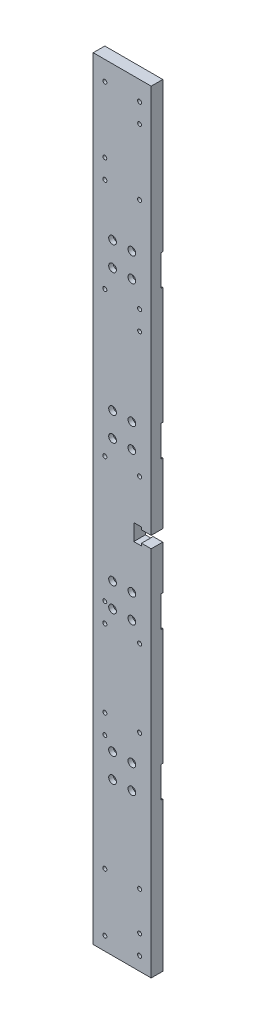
ISO-10303-21;
HEADER;
FILE_DESCRIPTION(('STEP AP214'),'2;1');
FILE_NAME('part.step','',(''),(''),'','','');
FILE_SCHEMA(('AUTOMOTIVE_DESIGN { 1 0 10303 214 1 1 1 1 }'));
ENDSEC;
DATA;
#1=APPLICATION_CONTEXT('core data for automotive mechanical design processes');
#2=APPLICATION_PROTOCOL_DEFINITION('international standard','automotive_design',2000,#1);
#3=PRODUCT_CONTEXT('',#1,'mechanical');
#4=PRODUCT('Part','Part','',(#3));
#5=PRODUCT_RELATED_PRODUCT_CATEGORY('part','',(#4));
#6=PRODUCT_DEFINITION_FORMATION('','',#4);
#7=PRODUCT_DEFINITION_CONTEXT('part definition',#1,'design');
#8=PRODUCT_DEFINITION('design','',#6,#7);
#9=PRODUCT_DEFINITION_SHAPE('','',#8);
#10=(LENGTH_UNIT() NAMED_UNIT(*) SI_UNIT(.MILLI.,.METRE.));
#11=(NAMED_UNIT(*) PLANE_ANGLE_UNIT() SI_UNIT($,.RADIAN.));
#12=(NAMED_UNIT(*) SI_UNIT($,.STERADIAN.) SOLID_ANGLE_UNIT());
#13=UNCERTAINTY_MEASURE_WITH_UNIT(LENGTH_MEASURE(1.E-05),#10,'distance_accuracy_value','');
#14=(GEOMETRIC_REPRESENTATION_CONTEXT(3) GLOBAL_UNCERTAINTY_ASSIGNED_CONTEXT((#13)) GLOBAL_UNIT_ASSIGNED_CONTEXT((#10,
#11,#12)) REPRESENTATION_CONTEXT('',''));
#15=CARTESIAN_POINT('',(0.,0.,0.));
#16=DIRECTION('',(0.,0.,1.));
#17=DIRECTION('',(1.,0.,0.));
#18=AXIS2_PLACEMENT_3D('',#15,#16,#17);
#19=CARTESIAN_POINT('',(89.3129054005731,430.502189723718,12.));
#20=DIRECTION('',(-1.,0.,0.));
#21=DIRECTION('',(0.,-1.,0.));
#22=AXIS2_PLACEMENT_3D('',#19,#20,#21);
#23=PLANE('',#22);
#24=DIRECTION('',(0.,1.,0.));
#25=VECTOR('',#24,1.);
#26=CARTESIAN_POINT('',(89.3129054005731,430.502189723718,12.));
#27=LINE('',#26,#25);
#28=CARTESIAN_POINT('',(89.3129054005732,27.502189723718,12.));
#29=VERTEX_POINT('',#28);
#30=CARTESIAN_POINT('',(89.3129054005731,430.502189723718,12.));
#31=VERTEX_POINT('',#30);
#32=EDGE_CURVE('E384',#29,#31,#27,.T.);
#33=ORIENTED_EDGE('',*,*,#32,.F.);
#34=DIRECTION('',(0.,0.,1.));
#35=VECTOR('',#34,1.);
#36=CARTESIAN_POINT('',(89.3129054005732,27.502189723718,0.));
#37=LINE('',#36,#35);
#38=CARTESIAN_POINT('',(89.3129054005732,27.502189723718,0.));
#39=VERTEX_POINT('',#38);
#40=EDGE_CURVE('E268',#39,#29,#37,.T.);
#41=ORIENTED_EDGE('',*,*,#40,.F.);
#42=DIRECTION('',(0.,1.,0.));
#43=VECTOR('',#42,1.);
#44=CARTESIAN_POINT('',(89.3129054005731,430.502189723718,0.));
#45=LINE('',#44,#43);
#46=CARTESIAN_POINT('',(89.3129054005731,91.0021897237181,0.));
#47=VERTEX_POINT('',#46);
#48=EDGE_CURVE('E403',#39,#47,#45,.T.);
#49=ORIENTED_EDGE('',*,*,#48,.T.);
#50=DIRECTION('',(0.,0.,-1.));
#51=VECTOR('',#50,1.);
#52=CARTESIAN_POINT('',(89.3129054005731,91.0021897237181,0.));
#53=LINE('',#52,#51);
#54=CARTESIAN_POINT('',(89.3129054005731,91.0021897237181,1.99999999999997));
#55=VERTEX_POINT('',#54);
#56=EDGE_CURVE('E355',#55,#47,#53,.T.);
#57=ORIENTED_EDGE('',*,*,#56,.F.);
#58=DIRECTION('',(0.,-1.,0.));
#59=VECTOR('',#58,1.);
#60=CARTESIAN_POINT('',(89.3129054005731,123.002189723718,2.));
#61=LINE('',#60,#59);
#62=CARTESIAN_POINT('',(89.3129054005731,123.002189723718,2.));
#63=VERTEX_POINT('',#62);
#64=EDGE_CURVE('E364',#63,#55,#61,.T.);
#65=ORIENTED_EDGE('',*,*,#64,.F.);
#66=DIRECTION('',(0.,0.,1.));
#67=VECTOR('',#66,1.);
#68=CARTESIAN_POINT('',(89.3129054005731,123.002189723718,0.));
#69=LINE('',#68,#67);
#70=CARTESIAN_POINT('',(89.3129054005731,123.002189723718,0.));
#71=VERTEX_POINT('',#70);
#72=EDGE_CURVE('E345',#71,#63,#69,.T.);
#73=ORIENTED_EDGE('',*,*,#72,.F.);
#74=CARTESIAN_POINT('',(89.3129054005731,244.002189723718,0.));
#75=VERTEX_POINT('',#74);
#76=EDGE_CURVE('E404',#71,#75,#45,.T.);
#77=ORIENTED_EDGE('',*,*,#76,.T.);
#78=DIRECTION('',(0.,0.,-1.));
#79=VECTOR('',#78,1.);
#80=CARTESIAN_POINT('',(89.3129054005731,244.002189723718,0.));
#81=LINE('',#80,#79);
#82=CARTESIAN_POINT('',(89.3129054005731,244.002189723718,2.));
#83=VERTEX_POINT('',#82);
#84=EDGE_CURVE('E329',#83,#75,#81,.T.);
#85=ORIENTED_EDGE('',*,*,#84,.F.);
#86=DIRECTION('',(0.,-1.,0.));
#87=VECTOR('',#86,1.);
#88=CARTESIAN_POINT('',(89.3129054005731,276.002189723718,2.));
#89=LINE('',#88,#87);
#90=CARTESIAN_POINT('',(89.3129054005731,276.002189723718,2.));
#91=VERTEX_POINT('',#90);
#92=EDGE_CURVE('E338',#91,#83,#89,.T.);
#93=ORIENTED_EDGE('',*,*,#92,.F.);
#94=DIRECTION('',(0.,0.,1.));
#95=VECTOR('',#94,1.);
#96=CARTESIAN_POINT('',(89.3129054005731,276.002189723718,0.));
#97=LINE('',#96,#95);
#98=CARTESIAN_POINT('',(89.3129054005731,276.002189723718,0.));
#99=VERTEX_POINT('',#98);
#100=EDGE_CURVE('E318',#99,#91,#97,.T.);
#101=ORIENTED_EDGE('',*,*,#100,.F.);
#102=CARTESIAN_POINT('',(89.3129054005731,430.502189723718,0.));
#103=VERTEX_POINT('',#102);
#104=EDGE_CURVE('E398',#99,#103,#45,.T.);
#105=ORIENTED_EDGE('',*,*,#104,.T.);
#106=DIRECTION('',(0.,0.,-1.));
#107=VECTOR('',#106,1.);
#108=CARTESIAN_POINT('',(89.3129054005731,430.502189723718,12.));
#109=LINE('',#108,#107);
#110=EDGE_CURVE('E408',#31,#103,#109,.T.);
#111=ORIENTED_EDGE('',*,*,#110,.F.);
#112=EDGE_LOOP('',(#33,#41,#49,#57,#65,#73,#77,#85,#93,#101,#105,#111));
#113=FACE_BOUND('',#112,.T.);
#114=ADVANCED_FACE('F16',(#113),#23,.F.);
#115=CARTESIAN_POINT('',(0.,0.,0.));
#116=DIRECTION('',(0.,0.,1.));
#117=DIRECTION('',(1.,0.,0.));
#118=AXIS2_PLACEMENT_3D('',#115,#116,#117);
#119=PLANE('',#118);
#120=CARTESIAN_POINT('',(77.3129054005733,-335.497810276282,0.));
#121=DIRECTION('',(0.,0.,1.));
#122=DIRECTION('',(1.,0.,0.));
#123=AXIS2_PLACEMENT_3D('',#120,#121,#122);
#124=CIRCLE('',#123,2.);
#125=CARTESIAN_POINT('',(79.3129054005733,-335.497810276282,0.));
#126=VERTEX_POINT('',#125);
#127=EDGE_CURVE('E1687',#126,#126,#124,.T.);
#128=ORIENTED_EDGE('',*,*,#127,.T.);
#129=EDGE_LOOP('',(#128));
#130=FACE_BOUND('',#129,.T.);
#131=CARTESIAN_POINT('',(77.3129054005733,-355.497810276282,0.));
#132=DIRECTION('',(0.,0.,1.));
#133=DIRECTION('',(1.,0.,0.));
#134=AXIS2_PLACEMENT_3D('',#131,#132,#133);
#135=CIRCLE('',#134,2.1);
#136=CARTESIAN_POINT('',(79.4129054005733,-355.497810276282,0.));
#137=VERTEX_POINT('',#136);
#138=EDGE_CURVE('E1723',#137,#137,#135,.T.);
#139=ORIENTED_EDGE('',*,*,#138,.T.);
#140=EDGE_LOOP('',(#139));
#141=FACE_BOUND('',#140,.T.);
#142=CARTESIAN_POINT('',(41.3129054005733,-355.497810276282,0.));
#143=DIRECTION('',(0.,0.,1.));
#144=DIRECTION('',(1.,0.,0.));
#145=AXIS2_PLACEMENT_3D('',#142,#143,#144);
#146=CIRCLE('',#145,2.1);
#147=CARTESIAN_POINT('',(43.4129054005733,-355.497810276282,0.));
#148=VERTEX_POINT('',#147);
#149=EDGE_CURVE('E1729',#148,#148,#146,.T.);
#150=ORIENTED_EDGE('',*,*,#149,.T.);
#151=EDGE_LOOP('',(#150));
#152=FACE_BOUND('',#151,.T.);
#153=CARTESIAN_POINT('',(41.3129054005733,-295.497810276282,0.));
#154=DIRECTION('',(0.,0.,1.));
#155=DIRECTION('',(1.,0.,0.));
#156=AXIS2_PLACEMENT_3D('',#153,#154,#155);
#157=CIRCLE('',#156,2.1);
#158=CARTESIAN_POINT('',(43.4129054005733,-295.497810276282,0.));
#159=VERTEX_POINT('',#158);
#160=EDGE_CURVE('E787',#159,#159,#157,.T.);
#161=ORIENTED_EDGE('',*,*,#160,.T.);
#162=EDGE_LOOP('',(#161));
#163=FACE_BOUND('',#162,.T.);
#164=CARTESIAN_POINT('',(77.3129054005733,-295.497810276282,0.));
#165=DIRECTION('',(0.,0.,1.));
#166=DIRECTION('',(1.,0.,0.));
#167=AXIS2_PLACEMENT_3D('',#164,#165,#166);
#168=CIRCLE('',#167,2.1);
#169=CARTESIAN_POINT('',(79.4129054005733,-295.497810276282,0.));
#170=VERTEX_POINT('',#169);
#171=EDGE_CURVE('E793',#170,#170,#168,.T.);
#172=ORIENTED_EDGE('',*,*,#171,.T.);
#173=EDGE_LOOP('',(#172));
#174=FACE_BOUND('',#173,.T.);
#175=DIRECTION('',(0.,-1.,0.));
#176=VECTOR('',#175,1.);
#177=CARTESIAN_POINT('',(29.3129054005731,430.502189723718,0.));
#178=LINE('',#177,#176);
#179=CARTESIAN_POINT('',(29.312905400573,-214.997810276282,0.));
#180=VERTEX_POINT('',#179);
#181=CARTESIAN_POINT('',(29.3129054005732,-369.497810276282,0.));
#182=VERTEX_POINT('',#181);
#183=EDGE_CURVE('E372',#180,#182,#178,.T.);
#184=ORIENTED_EDGE('',*,*,#183,.F.);
#185=DIRECTION('',(1.,0.,0.));
#186=VECTOR('',#185,1.);
#187=CARTESIAN_POINT('',(29.312905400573,-214.997810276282,0.));
#188=LINE('',#187,#186);
#189=CARTESIAN_POINT('',(89.3129054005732,-214.997810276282,0.));
#190=VERTEX_POINT('',#189);
#191=EDGE_CURVE('E284',#180,#190,#188,.T.);
#192=ORIENTED_EDGE('',*,*,#191,.T.);
#193=CARTESIAN_POINT('',(89.3129054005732,-369.497810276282,0.));
#194=VERTEX_POINT('',#193);
#195=EDGE_CURVE('E399',#194,#190,#45,.T.);
#196=ORIENTED_EDGE('',*,*,#195,.F.);
#197=DIRECTION('',(1.,0.,0.));
#198=VECTOR('',#197,1.);
#199=CARTESIAN_POINT('',(29.3129054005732,-369.497810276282,0.));
#200=LINE('',#199,#198);
#201=EDGE_CURVE('E394',#182,#194,#200,.T.);
#202=ORIENTED_EDGE('',*,*,#201,.F.);
#203=EDGE_LOOP('',(#184,#192,#196,#202));
#204=FACE_BOUND('',#203,.T.);
#205=ADVANCED_FACE('F624',(#130,#141,#152,#163,#174,#204),#119,.F.);
#206=CARTESIAN_POINT('',(41.3129054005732,-175.497810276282,0.));
#207=DIRECTION('',(0.,0.,1.));
#208=DIRECTION('',(1.,0.,0.));
#209=AXIS2_PLACEMENT_3D('',#206,#207,#208);
#210=CIRCLE('',#209,2.);
#211=CARTESIAN_POINT('',(43.3129054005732,-175.497810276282,0.));
#212=VERTEX_POINT('',#211);
#213=EDGE_CURVE('E1697',#212,#212,#210,.T.);
#214=ORIENTED_EDGE('',*,*,#213,.T.);
#215=EDGE_LOOP('',(#214));
#216=FACE_BOUND('',#215,.T.);
#217=CARTESIAN_POINT('',(77.3129054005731,-155.497810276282,0.));
#218=DIRECTION('',(0.,0.,1.));
#219=DIRECTION('',(1.,0.,0.));
#220=AXIS2_PLACEMENT_3D('',#217,#218,#219);
#221=CIRCLE('',#220,2.1);
#222=CARTESIAN_POINT('',(79.4129054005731,-155.497810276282,0.));
#223=VERTEX_POINT('',#222);
#224=EDGE_CURVE('E1735',#223,#223,#221,.T.);
#225=ORIENTED_EDGE('',*,*,#224,.T.);
#226=EDGE_LOOP('',(#225));
#227=FACE_BOUND('',#226,.T.);
#228=CARTESIAN_POINT('',(41.3129054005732,-155.497810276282,0.));
#229=DIRECTION('',(0.,0.,1.));
#230=DIRECTION('',(1.,0.,0.));
#231=AXIS2_PLACEMENT_3D('',#228,#229,#230);
#232=CIRCLE('',#231,2.1);
#233=CARTESIAN_POINT('',(43.4129054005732,-155.497810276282,0.));
#234=VERTEX_POINT('',#233);
#235=EDGE_CURVE('E1741',#234,#234,#232,.T.);
#236=ORIENTED_EDGE('',*,*,#235,.T.);
#237=EDGE_LOOP('',(#236));
#238=FACE_BOUND('',#237,.T.);
#239=CARTESIAN_POINT('',(41.3129054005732,-75.497810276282,0.));
#240=DIRECTION('',(0.,0.,1.));
#241=DIRECTION('',(1.,0.,0.));
#242=AXIS2_PLACEMENT_3D('',#239,#240,#241);
#243=CIRCLE('',#242,2.1);
#244=CARTESIAN_POINT('',(43.4129054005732,-75.497810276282,0.));
#245=VERTEX_POINT('',#244);
#246=EDGE_CURVE('E1747',#245,#245,#243,.T.);
#247=ORIENTED_EDGE('',*,*,#246,.T.);
#248=EDGE_LOOP('',(#247));
#249=FACE_BOUND('',#248,.T.);
#250=CARTESIAN_POINT('',(77.3129054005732,-75.497810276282,0.));
#251=DIRECTION('',(0.,0.,1.));
#252=DIRECTION('',(1.,0.,0.));
#253=AXIS2_PLACEMENT_3D('',#250,#251,#252);
#254=CIRCLE('',#253,2.1);
#255=CARTESIAN_POINT('',(79.4129054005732,-75.497810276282,0.));
#256=VERTEX_POINT('',#255);
#257=EDGE_CURVE('E1753',#256,#256,#254,.T.);
#258=ORIENTED_EDGE('',*,*,#257,.T.);
#259=EDGE_LOOP('',(#258));
#260=FACE_BOUND('',#259,.T.);
#261=CARTESIAN_POINT('',(89.3129054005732,-182.997810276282,0.));
#262=VERTEX_POINT('',#261);
#263=CARTESIAN_POINT('',(89.3129054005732,-61.9978102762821,0.));
#264=VERTEX_POINT('',#263);
#265=EDGE_CURVE('E402',#262,#264,#45,.T.);
#266=ORIENTED_EDGE('',*,*,#265,.F.);
#267=DIRECTION('',(1.,0.,0.));
#268=VECTOR('',#267,1.);
#269=CARTESIAN_POINT('',(29.312905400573,-182.997810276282,0.));
#270=LINE('',#269,#268);
#271=CARTESIAN_POINT('',(29.312905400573,-182.997810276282,0.));
#272=VERTEX_POINT('',#271);
#273=EDGE_CURVE('E41',#272,#262,#270,.T.);
#274=ORIENTED_EDGE('',*,*,#273,.F.);
#275=CARTESIAN_POINT('',(29.312905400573,-61.9978102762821,0.));
#276=VERTEX_POINT('',#275);
#277=EDGE_CURVE('E878',#276,#272,#178,.T.);
#278=ORIENTED_EDGE('',*,*,#277,.F.);
#279=DIRECTION('',(1.,0.,0.));
#280=VECTOR('',#279,1.);
#281=CARTESIAN_POINT('',(29.312905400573,-61.9978102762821,0.));
#282=LINE('',#281,#280);
#283=EDGE_CURVE('E308',#276,#264,#282,.T.);
#284=ORIENTED_EDGE('',*,*,#283,.T.);
#285=EDGE_LOOP('',(#266,#274,#278,#284));
#286=FACE_BOUND('',#285,.T.);
#287=ADVANCED_FACE('F632',(#216,#227,#238,#249,#260,#286),#119,.F.);
#288=CARTESIAN_POINT('',(77.3129054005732,204.502189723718,0.));
#289=DIRECTION('',(0.,0.,1.));
#290=DIRECTION('',(1.,0.,0.));
#291=AXIS2_PLACEMENT_3D('',#288,#289,#290);
#292=CIRCLE('',#291,2.);
#293=CARTESIAN_POINT('',(79.3129054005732,204.502189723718,0.));
#294=VERTEX_POINT('',#293);
#295=EDGE_CURVE('E1706',#294,#294,#292,.T.);
#296=ORIENTED_EDGE('',*,*,#295,.T.);
#297=EDGE_LOOP('',(#296));
#298=FACE_BOUND('',#297,.T.);
#299=CARTESIAN_POINT('',(41.3129054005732,224.502189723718,0.));
#300=DIRECTION('',(0.,0.,1.));
#301=DIRECTION('',(1.,0.,0.));
#302=AXIS2_PLACEMENT_3D('',#299,#300,#301);
#303=CIRCLE('',#302,2.1);
#304=CARTESIAN_POINT('',(43.4129054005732,224.502189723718,0.));
#305=VERTEX_POINT('',#304);
#306=EDGE_CURVE('E746',#305,#305,#303,.T.);
#307=ORIENTED_EDGE('',*,*,#306,.T.);
#308=EDGE_LOOP('',(#307));
#309=FACE_BOUND('',#308,.T.);
#310=CARTESIAN_POINT('',(77.3129054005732,224.502189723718,0.));
#311=DIRECTION('',(0.,0.,1.));
#312=DIRECTION('',(1.,0.,0.));
#313=AXIS2_PLACEMENT_3D('',#310,#311,#312);
#314=CIRCLE('',#313,2.1);
#315=CARTESIAN_POINT('',(79.4129054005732,224.502189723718,0.));
#316=VERTEX_POINT('',#315);
#317=EDGE_CURVE('E757',#316,#316,#314,.T.);
#318=ORIENTED_EDGE('',*,*,#317,.T.);
#319=EDGE_LOOP('',(#318));
#320=FACE_BOUND('',#319,.T.);
#321=CARTESIAN_POINT('',(29.312905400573,244.002189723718,0.));
#322=VERTEX_POINT('',#321);
#323=CARTESIAN_POINT('',(29.3129054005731,123.002189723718,0.));
#324=VERTEX_POINT('',#323);
#325=EDGE_CURVE('E395',#322,#324,#178,.T.);
#326=ORIENTED_EDGE('',*,*,#325,.F.);
#327=DIRECTION('',(1.,0.,0.));
#328=VECTOR('',#327,1.);
#329=CARTESIAN_POINT('',(29.312905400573,244.002189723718,0.));
#330=LINE('',#329,#328);
#331=EDGE_CURVE('E342',#322,#75,#330,.T.);
#332=ORIENTED_EDGE('',*,*,#331,.T.);
#333=ORIENTED_EDGE('',*,*,#76,.F.);
#334=DIRECTION('',(1.,0.,0.));
#335=VECTOR('',#334,1.);
#336=CARTESIAN_POINT('',(29.312905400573,123.002189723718,0.));
#337=LINE('',#336,#335);
#338=EDGE_CURVE('E361',#324,#71,#337,.T.);
#339=ORIENTED_EDGE('',*,*,#338,.F.);
#340=EDGE_LOOP('',(#326,#332,#333,#339));
#341=FACE_BOUND('',#340,.T.);
#342=ADVANCED_FACE('F669',(#298,#309,#320,#341),#119,.F.);
#343=CARTESIAN_POINT('',(77.3129054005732,74.502189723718,0.));
#344=DIRECTION('',(0.,0.,1.));
#345=DIRECTION('',(1.,0.,0.));
#346=AXIS2_PLACEMENT_3D('',#343,#344,#345);
#347=CIRCLE('',#346,2.1);
#348=CARTESIAN_POINT('',(79.4129054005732,74.502189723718,0.));
#349=VERTEX_POINT('',#348);
#350=EDGE_CURVE('E737',#349,#349,#347,.T.);
#351=ORIENTED_EDGE('',*,*,#350,.T.);
#352=EDGE_LOOP('',(#351));
#353=FACE_BOUND('',#352,.T.);
#354=CARTESIAN_POINT('',(41.3129054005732,74.502189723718,0.));
#355=DIRECTION('',(0.,0.,1.));
#356=DIRECTION('',(1.,0.,0.));
#357=AXIS2_PLACEMENT_3D('',#354,#355,#356);
#358=CIRCLE('',#357,2.1);
#359=CARTESIAN_POINT('',(43.4129054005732,74.502189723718,0.));
#360=VERTEX_POINT('',#359);
#361=EDGE_CURVE('E740',#360,#360,#358,.T.);
#362=ORIENTED_EDGE('',*,*,#361,.T.);
#363=EDGE_LOOP('',(#362));
#364=FACE_BOUND('',#363,.T.);
#365=ORIENTED_EDGE('',*,*,#48,.F.);
#366=DIRECTION('',(-1.,0.,0.));
#367=VECTOR('',#366,1.);
#368=CARTESIAN_POINT('',(89.3129054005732,27.502189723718,0.));
#369=LINE('',#368,#367);
#370=CARTESIAN_POINT('',(79.3129054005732,27.502189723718,0.));
#371=VERTEX_POINT('',#370);
#372=EDGE_CURVE('E236',#39,#371,#369,.T.);
#373=ORIENTED_EDGE('',*,*,#372,.T.);
#374=DIRECTION('',(0.,1.,0.));
#375=VECTOR('',#374,1.);
#376=CARTESIAN_POINT('',(79.3129054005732,27.502189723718,0.));
#377=LINE('',#376,#375);
#378=CARTESIAN_POINT('',(79.3129054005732,30.002189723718,0.));
#379=VERTEX_POINT('',#378);
#380=EDGE_CURVE('E239',#371,#379,#377,.T.);
#381=ORIENTED_EDGE('',*,*,#380,.T.);
#382=DIRECTION('',(-1.,0.,0.));
#383=VECTOR('',#382,1.);
#384=CARTESIAN_POINT('',(79.3129054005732,30.002189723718,0.));
#385=LINE('',#384,#383);
#386=CARTESIAN_POINT('',(71.3129054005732,30.002189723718,0.));
#387=VERTEX_POINT('',#386);
#388=EDGE_CURVE('E242',#379,#387,#385,.T.);
#389=ORIENTED_EDGE('',*,*,#388,.T.);
#390=DIRECTION('',(0.,-1.,0.));
#391=VECTOR('',#390,1.);
#392=CARTESIAN_POINT('',(71.3129054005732,30.002189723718,0.));
#393=LINE('',#392,#391);
#394=CARTESIAN_POINT('',(71.3129054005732,13.002189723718,0.));
#395=VERTEX_POINT('',#394);
#396=EDGE_CURVE('E212',#387,#395,#393,.T.);
#397=ORIENTED_EDGE('',*,*,#396,.T.);
#398=DIRECTION('',(1.,0.,0.));
#399=VECTOR('',#398,1.);
#400=CARTESIAN_POINT('',(79.3129054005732,13.002189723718,0.));
#401=LINE('',#400,#399);
#402=CARTESIAN_POINT('',(79.3129054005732,13.002189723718,0.));
#403=VERTEX_POINT('',#402);
#404=EDGE_CURVE('E206',#395,#403,#401,.T.);
#405=ORIENTED_EDGE('',*,*,#404,.T.);
#406=DIRECTION('',(0.,1.,0.));
#407=VECTOR('',#406,1.);
#408=CARTESIAN_POINT('',(79.3129054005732,15.502189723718,0.));
#409=LINE('',#408,#407);
#410=CARTESIAN_POINT('',(79.3129054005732,15.502189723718,0.));
#411=VERTEX_POINT('',#410);
#412=EDGE_CURVE('E215',#403,#411,#409,.T.);
#413=ORIENTED_EDGE('',*,*,#412,.T.);
#414=DIRECTION('',(1.,0.,0.));
#415=VECTOR('',#414,1.);
#416=CARTESIAN_POINT('',(89.3129054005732,15.502189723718,0.));
#417=LINE('',#416,#415);
#418=CARTESIAN_POINT('',(89.3129054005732,15.502189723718,0.));
#419=VERTEX_POINT('',#418);
#420=EDGE_CURVE('E220',#411,#419,#417,.T.);
#421=ORIENTED_EDGE('',*,*,#420,.T.);
#422=CARTESIAN_POINT('',(89.3129054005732,-29.997810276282,0.));
#423=VERTEX_POINT('',#422);
#424=EDGE_CURVE('E653',#423,#419,#45,.T.);
#425=ORIENTED_EDGE('',*,*,#424,.F.);
#426=DIRECTION('',(1.,0.,0.));
#427=VECTOR('',#426,1.);
#428=CARTESIAN_POINT('',(29.312905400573,-29.997810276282,0.));
#429=LINE('',#428,#427);
#430=CARTESIAN_POINT('',(29.312905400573,-29.997810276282,0.));
#431=VERTEX_POINT('',#430);
#432=EDGE_CURVE('E321',#431,#423,#429,.T.);
#433=ORIENTED_EDGE('',*,*,#432,.F.);
#434=CARTESIAN_POINT('',(29.312905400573,91.002189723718,0.));
#435=VERTEX_POINT('',#434);
#436=EDGE_CURVE('E396',#435,#431,#178,.T.);
#437=ORIENTED_EDGE('',*,*,#436,.F.);
#438=DIRECTION('',(1.,0.,0.));
#439=VECTOR('',#438,1.);
#440=CARTESIAN_POINT('',(29.312905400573,91.002189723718,0.));
#441=LINE('',#440,#439);
#442=EDGE_CURVE('E369',#435,#47,#441,.T.);
#443=ORIENTED_EDGE('',*,*,#442,.T.);
#444=EDGE_LOOP('',(#365,#373,#381,#389,#397,#405,#413,#421,#425,#433,#437,#443));
#445=FACE_BOUND('',#444,.T.);
#446=ADVANCED_FACE('F223',(#353,#364,#445),#119,.F.);
#447=CARTESIAN_POINT('',(29.3129054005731,430.502189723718,12.));
#448=DIRECTION('',(1.,0.,0.));
#449=DIRECTION('',(0.,1.,0.));
#450=AXIS2_PLACEMENT_3D('',#447,#448,#449);
#451=PLANE('',#450);
#452=DIRECTION('',(0.,-1.,0.));
#453=VECTOR('',#452,1.);
#454=CARTESIAN_POINT('',(29.312905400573,-214.997810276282,2.));
#455=LINE('',#454,#453);
#456=CARTESIAN_POINT('',(29.312905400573,-182.997810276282,2.));
#457=VERTEX_POINT('',#456);
#458=CARTESIAN_POINT('',(29.312905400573,-214.997810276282,2.));
#459=VERTEX_POINT('',#458);
#460=EDGE_CURVE('E281',#457,#459,#455,.T.);
#461=ORIENTED_EDGE('',*,*,#460,.T.);
#462=DIRECTION('',(0.,0.,-1.));
#463=VECTOR('',#462,1.);
#464=CARTESIAN_POINT('',(29.312905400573,-214.997810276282,0.));
#465=LINE('',#464,#463);
#466=EDGE_CURVE('E274',#459,#180,#465,.T.);
#467=ORIENTED_EDGE('',*,*,#466,.T.);
#468=ORIENTED_EDGE('',*,*,#183,.T.);
#469=DIRECTION('',(0.,0.,-1.));
#470=VECTOR('',#469,1.);
#471=CARTESIAN_POINT('',(29.3129054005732,-369.497810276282,12.));
#472=LINE('',#471,#470);
#473=CARTESIAN_POINT('',(29.3129054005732,-369.497810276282,12.));
#474=VERTEX_POINT('',#473);
#475=EDGE_CURVE('E11',#474,#182,#472,.T.);
#476=ORIENTED_EDGE('',*,*,#475,.F.);
#477=DIRECTION('',(0.,-1.,0.));
#478=VECTOR('',#477,1.);
#479=CARTESIAN_POINT('',(29.3129054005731,430.502189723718,12.));
#480=LINE('',#479,#478);
#481=CARTESIAN_POINT('',(29.3129054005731,430.502189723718,12.));
#482=VERTEX_POINT('',#481);
#483=EDGE_CURVE('E378',#482,#474,#480,.T.);
#484=ORIENTED_EDGE('',*,*,#483,.F.);
#485=DIRECTION('',(0.,0.,-1.));
#486=VECTOR('',#485,1.);
#487=CARTESIAN_POINT('',(29.3129054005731,430.502189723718,12.));
#488=LINE('',#487,#486);
#489=CARTESIAN_POINT('',(29.3129054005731,430.502189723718,0.));
#490=VERTEX_POINT('',#489);
#491=EDGE_CURVE('E390',#482,#490,#488,.T.);
#492=ORIENTED_EDGE('',*,*,#491,.T.);
#493=CARTESIAN_POINT('',(29.3129054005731,276.002189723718,0.));
#494=VERTEX_POINT('',#493);
#495=EDGE_CURVE('E391',#490,#494,#178,.T.);
#496=ORIENTED_EDGE('',*,*,#495,.T.);
#497=DIRECTION('',(0.,0.,1.));
#498=VECTOR('',#497,1.);
#499=CARTESIAN_POINT('',(29.312905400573,276.002189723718,0.));
#500=LINE('',#499,#498);
#501=CARTESIAN_POINT('',(29.312905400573,276.002189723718,2.));
#502=VERTEX_POINT('',#501);
#503=EDGE_CURVE('E325',#494,#502,#500,.T.);
#504=ORIENTED_EDGE('',*,*,#503,.T.);
#505=DIRECTION('',(0.,-1.,0.));
#506=VECTOR('',#505,1.);
#507=CARTESIAN_POINT('',(29.312905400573,276.002189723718,2.));
#508=LINE('',#507,#506);
#509=CARTESIAN_POINT('',(29.312905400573,244.002189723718,2.));
#510=VERTEX_POINT('',#509);
#511=EDGE_CURVE('E328',#502,#510,#508,.T.);
#512=ORIENTED_EDGE('',*,*,#511,.T.);
#513=DIRECTION('',(0.,0.,-1.));
#514=VECTOR('',#513,1.);
#515=CARTESIAN_POINT('',(29.312905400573,244.002189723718,0.));
#516=LINE('',#515,#514);
#517=EDGE_CURVE('E332',#510,#322,#516,.T.);
#518=ORIENTED_EDGE('',*,*,#517,.T.);
#519=ORIENTED_EDGE('',*,*,#325,.T.);
#520=DIRECTION('',(0.,0.,1.));
#521=VECTOR('',#520,1.);
#522=CARTESIAN_POINT('',(29.312905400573,123.002189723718,0.));
#523=LINE('',#522,#521);
#524=CARTESIAN_POINT('',(29.312905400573,123.002189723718,2.));
#525=VERTEX_POINT('',#524);
#526=EDGE_CURVE('E351',#324,#525,#523,.T.);
#527=ORIENTED_EDGE('',*,*,#526,.T.);
#528=DIRECTION('',(0.,-1.,0.));
#529=VECTOR('',#528,1.);
#530=CARTESIAN_POINT('',(29.312905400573,123.002189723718,2.));
#531=LINE('',#530,#529);
#532=CARTESIAN_POINT('',(29.312905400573,91.002189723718,1.99999999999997));
#533=VERTEX_POINT('',#532);
#534=EDGE_CURVE('E354',#525,#533,#531,.T.);
#535=ORIENTED_EDGE('',*,*,#534,.T.);
#536=DIRECTION('',(0.,0.,-1.));
#537=VECTOR('',#536,1.);
#538=CARTESIAN_POINT('',(29.312905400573,91.002189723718,0.));
#539=LINE('',#538,#537);
#540=EDGE_CURVE('E358',#533,#435,#539,.T.);
#541=ORIENTED_EDGE('',*,*,#540,.T.);
#542=ORIENTED_EDGE('',*,*,#436,.T.);
#543=DIRECTION('',(0.,0.,1.));
#544=VECTOR('',#543,1.);
#545=CARTESIAN_POINT('',(29.312905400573,-29.997810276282,0.));
#546=LINE('',#545,#544);
#547=CARTESIAN_POINT('',(29.312905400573,-29.997810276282,1.99999999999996));
#548=VERTEX_POINT('',#547);
#549=EDGE_CURVE('E301',#431,#548,#546,.T.);
#550=ORIENTED_EDGE('',*,*,#549,.T.);
#551=DIRECTION('',(0.,-1.,0.));
#552=VECTOR('',#551,1.);
#553=CARTESIAN_POINT('',(29.312905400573,-61.9978102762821,1.99999999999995));
#554=LINE('',#553,#552);
#555=CARTESIAN_POINT('',(29.312905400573,-61.9978102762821,1.99999999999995));
#556=VERTEX_POINT('',#555);
#557=EDGE_CURVE('E305',#548,#556,#554,.T.);
#558=ORIENTED_EDGE('',*,*,#557,.T.);
#559=DIRECTION('',(0.,0.,-1.));
#560=VECTOR('',#559,1.);
#561=CARTESIAN_POINT('',(29.312905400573,-61.9978102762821,0.));
#562=LINE('',#561,#560);
#563=EDGE_CURVE('E298',#556,#276,#562,.T.);
#564=ORIENTED_EDGE('',*,*,#563,.T.);
#565=ORIENTED_EDGE('',*,*,#277,.T.);
#566=DIRECTION('',(0.,0.,1.));
#567=VECTOR('',#566,1.);
#568=CARTESIAN_POINT('',(29.312905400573,-182.997810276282,0.));
#569=LINE('',#568,#567);
#570=EDGE_CURVE('E277',#272,#457,#569,.T.);
#571=ORIENTED_EDGE('',*,*,#570,.T.);
#572=EDGE_LOOP('',(#461,#467,#468,#476,#484,#492,#496,#504,#512,#518,#519,#527,#535,#541,#542,
#550,#558,#564,#565,#571));
#573=FACE_BOUND('',#572,.T.);
#574=ADVANCED_FACE('F18',(#573),#451,.F.);
#575=CARTESIAN_POINT('',(29.3129054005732,-369.497810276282,12.));
#576=DIRECTION('',(0.,1.,0.));
#577=DIRECTION('',(0.,0.,1.));
#578=AXIS2_PLACEMENT_3D('',#575,#576,#577);
#579=PLANE('',#578);
#580=ORIENTED_EDGE('',*,*,#201,.T.);
#581=DIRECTION('',(0.,0.,-1.));
#582=VECTOR('',#581,1.);
#583=CARTESIAN_POINT('',(89.3129054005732,-369.497810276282,12.));
#584=LINE('',#583,#582);
#585=CARTESIAN_POINT('',(89.3129054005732,-369.497810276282,12.));
#586=VERTEX_POINT('',#585);
#587=EDGE_CURVE('E25',#586,#194,#584,.T.);
#588=ORIENTED_EDGE('',*,*,#587,.F.);
#589=DIRECTION('',(1.,0.,0.));
#590=VECTOR('',#589,1.);
#591=CARTESIAN_POINT('',(29.3129054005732,-369.497810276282,12.));
#592=LINE('',#591,#590);
#593=EDGE_CURVE('E381',#474,#586,#592,.T.);
#594=ORIENTED_EDGE('',*,*,#593,.F.);
#595=ORIENTED_EDGE('',*,*,#475,.T.);
#596=EDGE_LOOP('',(#580,#588,#594,#595));
#597=FACE_BOUND('',#596,.T.);
#598=ADVANCED_FACE('F640',(#597),#579,.F.);
#599=ORIENTED_EDGE('',*,*,#424,.T.);
#600=DIRECTION('',(0.,0.,1.));
#601=VECTOR('',#600,1.);
#602=CARTESIAN_POINT('',(89.3129054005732,15.502189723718,0.));
#603=LINE('',#602,#601);
#604=CARTESIAN_POINT('',(89.3129054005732,15.502189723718,12.));
#605=VERTEX_POINT('',#604);
#606=EDGE_CURVE('E270',#419,#605,#603,.T.);
#607=ORIENTED_EDGE('',*,*,#606,.T.);
#608=EDGE_CURVE('E385',#586,#605,#27,.T.);
#609=ORIENTED_EDGE('',*,*,#608,.F.);
#610=ORIENTED_EDGE('',*,*,#587,.T.);
#611=ORIENTED_EDGE('',*,*,#195,.T.);
#612=DIRECTION('',(0.,0.,-1.));
#613=VECTOR('',#612,1.);
#614=CARTESIAN_POINT('',(89.3129054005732,-214.997810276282,0.));
#615=LINE('',#614,#613);
#616=CARTESIAN_POINT('',(89.3129054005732,-214.997810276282,2.));
#617=VERTEX_POINT('',#616);
#618=EDGE_CURVE('E261',#617,#190,#615,.T.);
#619=ORIENTED_EDGE('',*,*,#618,.F.);
#620=DIRECTION('',(0.,-1.,0.));
#621=VECTOR('',#620,1.);
#622=CARTESIAN_POINT('',(89.3129054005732,-214.997810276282,2.));
#623=LINE('',#622,#621);
#624=CARTESIAN_POINT('',(89.3129054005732,-182.997810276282,2.));
#625=VERTEX_POINT('',#624);
#626=EDGE_CURVE('E278',#625,#617,#623,.T.);
#627=ORIENTED_EDGE('',*,*,#626,.F.);
#628=DIRECTION('',(0.,0.,1.));
#629=VECTOR('',#628,1.);
#630=CARTESIAN_POINT('',(89.3129054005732,-182.997810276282,0.));
#631=LINE('',#630,#629);
#632=EDGE_CURVE('E286',#262,#625,#631,.T.);
#633=ORIENTED_EDGE('',*,*,#632,.F.);
#634=ORIENTED_EDGE('',*,*,#265,.T.);
#635=DIRECTION('',(0.,0.,-1.));
#636=VECTOR('',#635,1.);
#637=CARTESIAN_POINT('',(89.3129054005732,-61.9978102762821,0.));
#638=LINE('',#637,#636);
#639=CARTESIAN_POINT('',(89.3129054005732,-61.9978102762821,1.99999999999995));
#640=VERTEX_POINT('',#639);
#641=EDGE_CURVE('E292',#640,#264,#638,.T.);
#642=ORIENTED_EDGE('',*,*,#641,.F.);
#643=DIRECTION('',(0.,-1.,0.));
#644=VECTOR('',#643,1.);
#645=CARTESIAN_POINT('',(89.3129054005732,-61.9978102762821,1.99999999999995));
#646=LINE('',#645,#644);
#647=CARTESIAN_POINT('',(89.3129054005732,-29.997810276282,1.99999999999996));
#648=VERTEX_POINT('',#647);
#649=EDGE_CURVE('E302',#648,#640,#646,.T.);
#650=ORIENTED_EDGE('',*,*,#649,.F.);
#651=DIRECTION('',(0.,0.,1.));
#652=VECTOR('',#651,1.);
#653=CARTESIAN_POINT('',(89.3129054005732,-29.997810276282,0.));
#654=LINE('',#653,#652);
#655=EDGE_CURVE('E311',#423,#648,#654,.T.);
#656=ORIENTED_EDGE('',*,*,#655,.F.);
#657=EDGE_LOOP('',(#599,#607,#609,#610,#611,#619,#627,#633,#634,#642,#650,#656));
#658=FACE_BOUND('',#657,.T.);
#659=ADVANCED_FACE('F627',(#658),#23,.F.);
#660=CARTESIAN_POINT('',(29.3129054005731,430.502189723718,12.));
#661=DIRECTION('',(0.,-1.,0.));
#662=DIRECTION('',(0.,0.,-1.));
#663=AXIS2_PLACEMENT_3D('',#660,#661,#662);
#664=PLANE('',#663);
#665=DIRECTION('',(-1.,0.,0.));
#666=VECTOR('',#665,1.);
#667=CARTESIAN_POINT('',(29.3129054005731,430.502189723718,0.));
#668=LINE('',#667,#666);
#669=EDGE_CURVE('E382',#103,#490,#668,.T.);
#670=ORIENTED_EDGE('',*,*,#669,.T.);
#671=ORIENTED_EDGE('',*,*,#491,.F.);
#672=DIRECTION('',(-1.,0.,0.));
#673=VECTOR('',#672,1.);
#674=CARTESIAN_POINT('',(29.3129054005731,430.502189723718,12.));
#675=LINE('',#674,#673);
#676=EDGE_CURVE('E388',#31,#482,#675,.T.);
#677=ORIENTED_EDGE('',*,*,#676,.F.);
#678=ORIENTED_EDGE('',*,*,#110,.T.);
#679=EDGE_LOOP('',(#670,#671,#677,#678));
#680=FACE_BOUND('',#679,.T.);
#681=ADVANCED_FACE('F639',(#680),#664,.F.);
#682=CARTESIAN_POINT('',(0.,0.,12.));
#683=DIRECTION('',(0.,0.,1.));
#684=DIRECTION('',(1.,0.,0.));
#685=AXIS2_PLACEMENT_3D('',#682,#683,#684);
#686=PLANE('',#685);
#687=CARTESIAN_POINT('',(77.3129054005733,-335.497810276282,12.));
#688=DIRECTION('',(0.,0.,1.));
#689=DIRECTION('',(1.,0.,0.));
#690=AXIS2_PLACEMENT_3D('',#687,#688,#689);
#691=CIRCLE('',#690,2.);
#692=CARTESIAN_POINT('',(79.3129054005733,-335.497810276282,12.));
#693=VERTEX_POINT('',#692);
#694=EDGE_CURVE('E1690',#693,#693,#691,.T.);
#695=ORIENTED_EDGE('',*,*,#694,.F.);
#696=EDGE_LOOP('',(#695));
#697=FACE_BOUND('',#696,.T.);
#698=CARTESIAN_POINT('',(41.3129054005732,-175.497810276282,12.));
#699=DIRECTION('',(0.,0.,1.));
#700=DIRECTION('',(1.,0.,0.));
#701=AXIS2_PLACEMENT_3D('',#698,#699,#700);
#702=CIRCLE('',#701,2.);
#703=CARTESIAN_POINT('',(43.3129054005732,-175.497810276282,12.));
#704=VERTEX_POINT('',#703);
#705=EDGE_CURVE('E1692',#704,#704,#702,.T.);
#706=ORIENTED_EDGE('',*,*,#705,.F.);
#707=EDGE_LOOP('',(#706));
#708=FACE_BOUND('',#707,.T.);
#709=CARTESIAN_POINT('',(41.3129054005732,-55.497810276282,12.));
#710=DIRECTION('',(0.,0.,1.));
#711=DIRECTION('',(1.,0.,0.));
#712=AXIS2_PLACEMENT_3D('',#709,#710,#711);
#713=CIRCLE('',#712,2.);
#714=CARTESIAN_POINT('',(43.3129054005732,-55.497810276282,12.));
#715=VERTEX_POINT('',#714);
#716=EDGE_CURVE('E1700',#715,#715,#713,.T.);
#717=ORIENTED_EDGE('',*,*,#716,.F.);
#718=EDGE_LOOP('',(#717));
#719=FACE_BOUND('',#718,.T.);
#720=CARTESIAN_POINT('',(77.3129054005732,204.502189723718,12.));
#721=DIRECTION('',(0.,0.,1.));
#722=DIRECTION('',(1.,0.,0.));
#723=AXIS2_PLACEMENT_3D('',#720,#721,#722);
#724=CIRCLE('',#723,2.);
#725=CARTESIAN_POINT('',(79.3129054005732,204.502189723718,12.));
#726=VERTEX_POINT('',#725);
#727=EDGE_CURVE('E1703',#726,#726,#724,.T.);
#728=ORIENTED_EDGE('',*,*,#727,.F.);
#729=EDGE_LOOP('',(#728));
#730=FACE_BOUND('',#729,.T.);
#731=CARTESIAN_POINT('',(41.3129054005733,342.502189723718,12.));
#732=DIRECTION('',(0.,0.,1.));
#733=DIRECTION('',(1.,0.,0.));
#734=AXIS2_PLACEMENT_3D('',#731,#732,#733);
#735=CIRCLE('',#734,2.);
#736=CARTESIAN_POINT('',(43.3129054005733,342.502189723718,12.));
#737=VERTEX_POINT('',#736);
#738=EDGE_CURVE('E1709',#737,#737,#735,.T.);
#739=ORIENTED_EDGE('',*,*,#738,.F.);
#740=EDGE_LOOP('',(#739));
#741=FACE_BOUND('',#740,.T.);
#742=CARTESIAN_POINT('',(77.3129054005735,390.502189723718,12.));
#743=DIRECTION('',(0.,0.,1.));
#744=DIRECTION('',(1.,0.,0.));
#745=AXIS2_PLACEMENT_3D('',#742,#743,#744);
#746=CIRCLE('',#745,2.);
#747=CARTESIAN_POINT('',(79.3129054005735,390.502189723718,12.));
#748=VERTEX_POINT('',#747);
#749=EDGE_CURVE('E1714',#748,#748,#746,.T.);
#750=ORIENTED_EDGE('',*,*,#749,.F.);
#751=EDGE_LOOP('',(#750));
#752=FACE_BOUND('',#751,.T.);
#753=CARTESIAN_POINT('',(77.3129054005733,-355.497810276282,12.));
#754=DIRECTION('',(0.,0.,1.));
#755=DIRECTION('',(1.,0.,0.));
#756=AXIS2_PLACEMENT_3D('',#753,#754,#755);
#757=CIRCLE('',#756,2.1);
#758=CARTESIAN_POINT('',(79.4129054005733,-355.497810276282,12.));
#759=VERTEX_POINT('',#758);
#760=EDGE_CURVE('E1720',#759,#759,#757,.T.);
#761=ORIENTED_EDGE('',*,*,#760,.F.);
#762=EDGE_LOOP('',(#761));
#763=FACE_BOUND('',#762,.T.);
#764=CARTESIAN_POINT('',(41.3129054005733,-355.497810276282,12.));
#765=DIRECTION('',(0.,0.,1.));
#766=DIRECTION('',(1.,0.,0.));
#767=AXIS2_PLACEMENT_3D('',#764,#765,#766);
#768=CIRCLE('',#767,2.1);
#769=CARTESIAN_POINT('',(43.4129054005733,-355.497810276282,12.));
#770=VERTEX_POINT('',#769);
#771=EDGE_CURVE('E1726',#770,#770,#768,.T.);
#772=ORIENTED_EDGE('',*,*,#771,.F.);
#773=EDGE_LOOP('',(#772));
#774=FACE_BOUND('',#773,.T.);
#775=CARTESIAN_POINT('',(77.3129054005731,-155.497810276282,12.));
#776=DIRECTION('',(0.,0.,1.));
#777=DIRECTION('',(1.,0.,0.));
#778=AXIS2_PLACEMENT_3D('',#775,#776,#777);
#779=CIRCLE('',#778,2.1);
#780=CARTESIAN_POINT('',(79.4129054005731,-155.497810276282,12.));
#781=VERTEX_POINT('',#780);
#782=EDGE_CURVE('E1732',#781,#781,#779,.T.);
#783=ORIENTED_EDGE('',*,*,#782,.F.);
#784=EDGE_LOOP('',(#783));
#785=FACE_BOUND('',#784,.T.);
#786=CARTESIAN_POINT('',(41.3129054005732,-155.497810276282,12.));
#787=DIRECTION('',(0.,0.,1.));
#788=DIRECTION('',(1.,0.,0.));
#789=AXIS2_PLACEMENT_3D('',#786,#787,#788);
#790=CIRCLE('',#789,2.1);
#791=CARTESIAN_POINT('',(43.4129054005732,-155.497810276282,12.));
#792=VERTEX_POINT('',#791);
#793=EDGE_CURVE('E1738',#792,#792,#790,.T.);
#794=ORIENTED_EDGE('',*,*,#793,.F.);
#795=EDGE_LOOP('',(#794));
#796=FACE_BOUND('',#795,.T.);
#797=CARTESIAN_POINT('',(41.3129054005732,-75.497810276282,12.));
#798=DIRECTION('',(0.,0.,1.));
#799=DIRECTION('',(1.,0.,0.));
#800=AXIS2_PLACEMENT_3D('',#797,#798,#799);
#801=CIRCLE('',#800,2.1);
#802=CARTESIAN_POINT('',(43.4129054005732,-75.497810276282,12.));
#803=VERTEX_POINT('',#802);
#804=EDGE_CURVE('E1744',#803,#803,#801,.T.);
#805=ORIENTED_EDGE('',*,*,#804,.F.);
#806=EDGE_LOOP('',(#805));
#807=FACE_BOUND('',#806,.T.);
#808=CARTESIAN_POINT('',(77.3129054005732,-75.497810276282,12.));
#809=DIRECTION('',(0.,0.,1.));
#810=DIRECTION('',(1.,0.,0.));
#811=AXIS2_PLACEMENT_3D('',#808,#809,#810);
#812=CIRCLE('',#811,2.1);
#813=CARTESIAN_POINT('',(79.4129054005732,-75.497810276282,12.));
#814=VERTEX_POINT('',#813);
#815=EDGE_CURVE('E1750',#814,#814,#812,.T.);
#816=ORIENTED_EDGE('',*,*,#815,.F.);
#817=EDGE_LOOP('',(#816));
#818=FACE_BOUND('',#817,.T.);
#819=CARTESIAN_POINT('',(77.3129054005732,74.502189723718,12.));
#820=DIRECTION('',(0.,0.,1.));
#821=DIRECTION('',(1.,0.,0.));
#822=AXIS2_PLACEMENT_3D('',#819,#820,#821);
#823=CIRCLE('',#822,2.1);
#824=CARTESIAN_POINT('',(79.4129054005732,74.502189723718,12.));
#825=VERTEX_POINT('',#824);
#826=EDGE_CURVE('E1756',#825,#825,#823,.T.);
#827=ORIENTED_EDGE('',*,*,#826,.F.);
#828=EDGE_LOOP('',(#827));
#829=FACE_BOUND('',#828,.T.);
#830=CARTESIAN_POINT('',(41.3129054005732,74.502189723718,12.));
#831=DIRECTION('',(0.,0.,1.));
#832=DIRECTION('',(1.,0.,0.));
#833=AXIS2_PLACEMENT_3D('',#830,#831,#832);
#834=CIRCLE('',#833,2.1);
#835=CARTESIAN_POINT('',(43.4129054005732,74.502189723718,12.));
#836=VERTEX_POINT('',#835);
#837=EDGE_CURVE('E743',#836,#836,#834,.T.);
#838=ORIENTED_EDGE('',*,*,#837,.F.);
#839=EDGE_LOOP('',(#838));
#840=FACE_BOUND('',#839,.T.);
#841=CARTESIAN_POINT('',(41.3129054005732,224.502189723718,12.));
#842=DIRECTION('',(0.,0.,1.));
#843=DIRECTION('',(1.,0.,0.));
#844=AXIS2_PLACEMENT_3D('',#841,#842,#843);
#845=CIRCLE('',#844,2.1);
#846=CARTESIAN_POINT('',(43.4129054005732,224.502189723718,12.));
#847=VERTEX_POINT('',#846);
#848=EDGE_CURVE('E742',#847,#847,#845,.T.);
#849=ORIENTED_EDGE('',*,*,#848,.F.);
#850=EDGE_LOOP('',(#849));
#851=FACE_BOUND('',#850,.T.);
#852=CARTESIAN_POINT('',(77.3129054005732,224.502189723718,12.));
#853=DIRECTION('',(0.,0.,1.));
#854=DIRECTION('',(1.,0.,0.));
#855=AXIS2_PLACEMENT_3D('',#852,#853,#854);
#856=CIRCLE('',#855,2.1);
#857=CARTESIAN_POINT('',(79.4129054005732,224.502189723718,12.));
#858=VERTEX_POINT('',#857);
#859=EDGE_CURVE('E754',#858,#858,#856,.T.);
#860=ORIENTED_EDGE('',*,*,#859,.F.);
#861=EDGE_LOOP('',(#860));
#862=FACE_BOUND('',#861,.T.);
#863=CARTESIAN_POINT('',(77.3129054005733,322.502189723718,12.));
#864=DIRECTION('',(0.,0.,1.));
#865=DIRECTION('',(1.,0.,0.));
#866=AXIS2_PLACEMENT_3D('',#863,#864,#865);
#867=CIRCLE('',#866,2.1);
#868=CARTESIAN_POINT('',(79.4129054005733,322.502189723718,12.));
#869=VERTEX_POINT('',#868);
#870=EDGE_CURVE('E760',#869,#869,#867,.T.);
#871=ORIENTED_EDGE('',*,*,#870,.F.);
#872=EDGE_LOOP('',(#871));
#873=FACE_BOUND('',#872,.T.);
#874=CARTESIAN_POINT('',(41.3129054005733,322.502189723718,12.));
#875=DIRECTION('',(0.,0.,1.));
#876=DIRECTION('',(1.,0.,0.));
#877=AXIS2_PLACEMENT_3D('',#874,#875,#876);
#878=CIRCLE('',#877,2.1);
#879=CARTESIAN_POINT('',(43.4129054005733,322.502189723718,12.));
#880=VERTEX_POINT('',#879);
#881=EDGE_CURVE('E766',#880,#880,#878,.T.);
#882=ORIENTED_EDGE('',*,*,#881,.F.);
#883=EDGE_LOOP('',(#882));
#884=FACE_BOUND('',#883,.T.);
#885=CARTESIAN_POINT('',(41.3129054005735,410.502189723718,12.));
#886=DIRECTION('',(0.,0.,1.));
#887=DIRECTION('',(1.,0.,0.));
#888=AXIS2_PLACEMENT_3D('',#885,#886,#887);
#889=CIRCLE('',#888,2.1);
#890=CARTESIAN_POINT('',(43.4129054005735,410.502189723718,12.));
#891=VERTEX_POINT('',#890);
#892=EDGE_CURVE('E772',#891,#891,#889,.T.);
#893=ORIENTED_EDGE('',*,*,#892,.F.);
#894=EDGE_LOOP('',(#893));
#895=FACE_BOUND('',#894,.T.);
#896=CARTESIAN_POINT('',(77.3129054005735,410.502189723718,12.));
#897=DIRECTION('',(0.,0.,1.));
#898=DIRECTION('',(1.,0.,0.));
#899=AXIS2_PLACEMENT_3D('',#896,#897,#898);
#900=CIRCLE('',#899,2.1);
#901=CARTESIAN_POINT('',(79.4129054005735,410.502189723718,12.));
#902=VERTEX_POINT('',#901);
#903=EDGE_CURVE('E778',#902,#902,#900,.T.);
#904=ORIENTED_EDGE('',*,*,#903,.F.);
#905=EDGE_LOOP('',(#904));
#906=FACE_BOUND('',#905,.T.);
#907=CARTESIAN_POINT('',(41.3129054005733,-295.497810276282,12.));
#908=DIRECTION('',(0.,0.,1.));
#909=DIRECTION('',(1.,0.,0.));
#910=AXIS2_PLACEMENT_3D('',#907,#908,#909);
#911=CIRCLE('',#910,2.1);
#912=CARTESIAN_POINT('',(43.4129054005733,-295.497810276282,12.));
#913=VERTEX_POINT('',#912);
#914=EDGE_CURVE('E784',#913,#913,#911,.T.);
#915=ORIENTED_EDGE('',*,*,#914,.F.);
#916=EDGE_LOOP('',(#915));
#917=FACE_BOUND('',#916,.T.);
#918=CARTESIAN_POINT('',(77.3129054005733,-295.497810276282,12.));
#919=DIRECTION('',(0.,0.,1.));
#920=DIRECTION('',(1.,0.,0.));
#921=AXIS2_PLACEMENT_3D('',#918,#919,#920);
#922=CIRCLE('',#921,2.1);
#923=CARTESIAN_POINT('',(79.4129054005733,-295.497810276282,12.));
#924=VERTEX_POINT('',#923);
#925=EDGE_CURVE('E790',#924,#924,#922,.T.);
#926=ORIENTED_EDGE('',*,*,#925,.F.);
#927=EDGE_LOOP('',(#926));
#928=FACE_BOUND('',#927,.T.);
#929=CARTESIAN_POINT('',(49.3129054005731,247.502189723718,12.));
#930=DIRECTION('',(0.,0.,1.));
#931=DIRECTION('',(1.,0.,0.));
#932=AXIS2_PLACEMENT_3D('',#929,#930,#931);
#933=CIRCLE('',#932,4.);
#934=CARTESIAN_POINT('',(53.3129054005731,247.502189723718,12.));
#935=VERTEX_POINT('',#934);
#936=EDGE_CURVE('E499',#935,#935,#933,.T.);
#937=ORIENTED_EDGE('',*,*,#936,.F.);
#938=EDGE_LOOP('',(#937));
#939=FACE_BOUND('',#938,.T.);
#940=CARTESIAN_POINT('',(49.3129054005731,272.502189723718,12.));
#941=DIRECTION('',(0.,0.,1.));
#942=DIRECTION('',(1.,0.,0.));
#943=AXIS2_PLACEMENT_3D('',#940,#941,#942);
#944=CIRCLE('',#943,4.);
#945=CARTESIAN_POINT('',(53.3129054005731,272.502189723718,12.));
#946=VERTEX_POINT('',#945);
#947=EDGE_CURVE('E486',#946,#946,#944,.T.);
#948=ORIENTED_EDGE('',*,*,#947,.F.);
#949=EDGE_LOOP('',(#948));
#950=FACE_BOUND('',#949,.T.);
#951=CARTESIAN_POINT('',(69.3129054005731,272.502189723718,12.));
#952=DIRECTION('',(0.,0.,1.));
#953=DIRECTION('',(1.,0.,0.));
#954=AXIS2_PLACEMENT_3D('',#951,#952,#953);
#955=CIRCLE('',#954,4.);
#956=CARTESIAN_POINT('',(73.3129054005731,272.502189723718,12.));
#957=VERTEX_POINT('',#956);
#958=EDGE_CURVE('E482',#957,#957,#955,.T.);
#959=ORIENTED_EDGE('',*,*,#958,.F.);
#960=EDGE_LOOP('',(#959));
#961=FACE_BOUND('',#960,.T.);
#962=CARTESIAN_POINT('',(69.3129054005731,247.502189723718,12.));
#963=DIRECTION('',(0.,0.,1.));
#964=DIRECTION('',(1.,0.,0.));
#965=AXIS2_PLACEMENT_3D('',#962,#963,#964);
#966=CIRCLE('',#965,4.);
#967=CARTESIAN_POINT('',(73.3129054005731,247.502189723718,12.));
#968=VERTEX_POINT('',#967);
#969=EDGE_CURVE('E478',#968,#968,#966,.T.);
#970=ORIENTED_EDGE('',*,*,#969,.F.);
#971=EDGE_LOOP('',(#970));
#972=FACE_BOUND('',#971,.T.);
#973=CARTESIAN_POINT('',(49.3129054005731,94.502189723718,12.));
#974=DIRECTION('',(0.,0.,1.));
#975=DIRECTION('',(1.,0.,0.));
#976=AXIS2_PLACEMENT_3D('',#973,#974,#975);
#977=CIRCLE('',#976,4.);
#978=CARTESIAN_POINT('',(53.3129054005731,94.502189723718,12.));
#979=VERTEX_POINT('',#978);
#980=EDGE_CURVE('E473',#979,#979,#977,.T.);
#981=ORIENTED_EDGE('',*,*,#980,.F.);
#982=EDGE_LOOP('',(#981));
#983=FACE_BOUND('',#982,.T.);
#984=CARTESIAN_POINT('',(49.3129054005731,119.502189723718,12.));
#985=DIRECTION('',(0.,0.,1.));
#986=DIRECTION('',(1.,0.,0.));
#987=AXIS2_PLACEMENT_3D('',#984,#985,#986);
#988=CIRCLE('',#987,4.);
#989=CARTESIAN_POINT('',(53.3129054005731,119.502189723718,12.));
#990=VERTEX_POINT('',#989);
#991=EDGE_CURVE('E468',#990,#990,#988,.T.);
#992=ORIENTED_EDGE('',*,*,#991,.F.);
#993=EDGE_LOOP('',(#992));
#994=FACE_BOUND('',#993,.T.);
#995=CARTESIAN_POINT('',(69.3129054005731,119.502189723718,12.));
#996=DIRECTION('',(0.,0.,1.));
#997=DIRECTION('',(1.,0.,0.));
#998=AXIS2_PLACEMENT_3D('',#995,#996,#997);
#999=CIRCLE('',#998,4.);
#1000=CARTESIAN_POINT('',(73.3129054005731,119.502189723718,12.));
#1001=VERTEX_POINT('',#1000);
#1002=EDGE_CURVE('E463',#1001,#1001,#999,.T.);
#1003=ORIENTED_EDGE('',*,*,#1002,.F.);
#1004=EDGE_LOOP('',(#1003));
#1005=FACE_BOUND('',#1004,.T.);
#1006=CARTESIAN_POINT('',(69.3129054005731,94.502189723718,12.));
#1007=DIRECTION('',(0.,0.,1.));
#1008=DIRECTION('',(1.,0.,0.));
#1009=AXIS2_PLACEMENT_3D('',#1006,#1007,#1008);
#1010=CIRCLE('',#1009,4.);
#1011=CARTESIAN_POINT('',(73.3129054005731,94.502189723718,12.));
#1012=VERTEX_POINT('',#1011);
#1013=EDGE_CURVE('E458',#1012,#1012,#1010,.T.);
#1014=ORIENTED_EDGE('',*,*,#1013,.F.);
#1015=EDGE_LOOP('',(#1014));
#1016=FACE_BOUND('',#1015,.T.);
#1017=CARTESIAN_POINT('',(49.3129054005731,-58.497810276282,12.));
#1018=DIRECTION('',(0.,0.,1.));
#1019=DIRECTION('',(1.,0.,0.));
#1020=AXIS2_PLACEMENT_3D('',#1017,#1018,#1019);
#1021=CIRCLE('',#1020,4.);
#1022=CARTESIAN_POINT('',(53.3129054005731,-58.497810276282,12.));
#1023=VERTEX_POINT('',#1022);
#1024=EDGE_CURVE('E453',#1023,#1023,#1021,.T.);
#1025=ORIENTED_EDGE('',*,*,#1024,.F.);
#1026=EDGE_LOOP('',(#1025));
#1027=FACE_BOUND('',#1026,.T.);
#1028=CARTESIAN_POINT('',(49.3129054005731,-33.497810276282,12.));
#1029=DIRECTION('',(0.,0.,1.));
#1030=DIRECTION('',(1.,0.,0.));
#1031=AXIS2_PLACEMENT_3D('',#1028,#1029,#1030);
#1032=CIRCLE('',#1031,4.);
#1033=CARTESIAN_POINT('',(53.3129054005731,-33.497810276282,12.));
#1034=VERTEX_POINT('',#1033);
#1035=EDGE_CURVE('E448',#1034,#1034,#1032,.T.);
#1036=ORIENTED_EDGE('',*,*,#1035,.F.);
#1037=EDGE_LOOP('',(#1036));
#1038=FACE_BOUND('',#1037,.T.);
#1039=CARTESIAN_POINT('',(69.3129054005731,-33.497810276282,12.));
#1040=DIRECTION('',(0.,0.,1.));
#1041=DIRECTION('',(1.,0.,0.));
#1042=AXIS2_PLACEMENT_3D('',#1039,#1040,#1041);
#1043=CIRCLE('',#1042,4.);
#1044=CARTESIAN_POINT('',(73.3129054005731,-33.497810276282,12.));
#1045=VERTEX_POINT('',#1044);
#1046=EDGE_CURVE('E443',#1045,#1045,#1043,.T.);
#1047=ORIENTED_EDGE('',*,*,#1046,.F.);
#1048=EDGE_LOOP('',(#1047));
#1049=FACE_BOUND('',#1048,.T.);
#1050=CARTESIAN_POINT('',(69.3129054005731,-58.497810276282,12.));
#1051=DIRECTION('',(0.,0.,1.));
#1052=DIRECTION('',(1.,0.,0.));
#1053=AXIS2_PLACEMENT_3D('',#1050,#1051,#1052);
#1054=CIRCLE('',#1053,4.);
#1055=CARTESIAN_POINT('',(73.3129054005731,-58.497810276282,12.));
#1056=VERTEX_POINT('',#1055);
#1057=EDGE_CURVE('E438',#1056,#1056,#1054,.T.);
#1058=ORIENTED_EDGE('',*,*,#1057,.F.);
#1059=EDGE_LOOP('',(#1058));
#1060=FACE_BOUND('',#1059,.T.);
#1061=CARTESIAN_POINT('',(49.3129054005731,-211.497810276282,12.));
#1062=DIRECTION('',(0.,0.,1.));
#1063=DIRECTION('',(1.,0.,0.));
#1064=AXIS2_PLACEMENT_3D('',#1061,#1062,#1063);
#1065=CIRCLE('',#1064,4.);
#1066=CARTESIAN_POINT('',(53.3129054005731,-211.497810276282,12.));
#1067=VERTEX_POINT('',#1066);
#1068=EDGE_CURVE('E433',#1067,#1067,#1065,.T.);
#1069=ORIENTED_EDGE('',*,*,#1068,.F.);
#1070=EDGE_LOOP('',(#1069));
#1071=FACE_BOUND('',#1070,.T.);
#1072=CARTESIAN_POINT('',(49.3129054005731,-186.497810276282,12.));
#1073=DIRECTION('',(0.,0.,1.));
#1074=DIRECTION('',(1.,0.,0.));
#1075=AXIS2_PLACEMENT_3D('',#1072,#1073,#1074);
#1076=CIRCLE('',#1075,4.);
#1077=CARTESIAN_POINT('',(53.3129054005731,-186.497810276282,12.));
#1078=VERTEX_POINT('',#1077);
#1079=EDGE_CURVE('E428',#1078,#1078,#1076,.T.);
#1080=ORIENTED_EDGE('',*,*,#1079,.F.);
#1081=EDGE_LOOP('',(#1080));
#1082=FACE_BOUND('',#1081,.T.);
#1083=CARTESIAN_POINT('',(69.3129054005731,-186.497810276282,12.));
#1084=DIRECTION('',(0.,0.,1.));
#1085=DIRECTION('',(1.,0.,0.));
#1086=AXIS2_PLACEMENT_3D('',#1083,#1084,#1085);
#1087=CIRCLE('',#1086,4.);
#1088=CARTESIAN_POINT('',(73.3129054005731,-186.497810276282,12.));
#1089=VERTEX_POINT('',#1088);
#1090=EDGE_CURVE('E423',#1089,#1089,#1087,.T.);
#1091=ORIENTED_EDGE('',*,*,#1090,.F.);
#1092=EDGE_LOOP('',(#1091));
#1093=FACE_BOUND('',#1092,.T.);
#1094=CARTESIAN_POINT('',(69.3129054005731,-211.497810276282,12.));
#1095=DIRECTION('',(0.,0.,1.));
#1096=DIRECTION('',(1.,0.,0.));
#1097=AXIS2_PLACEMENT_3D('',#1094,#1095,#1096);
#1098=CIRCLE('',#1097,4.);
#1099=CARTESIAN_POINT('',(73.3129054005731,-211.497810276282,12.));
#1100=VERTEX_POINT('',#1099);
#1101=EDGE_CURVE('E418',#1100,#1100,#1098,.T.);
#1102=ORIENTED_EDGE('',*,*,#1101,.F.);
#1103=EDGE_LOOP('',(#1102));
#1104=FACE_BOUND('',#1103,.T.);
#1105=DIRECTION('',(-1.,0.,0.));
#1106=VECTOR('',#1105,1.);
#1107=CARTESIAN_POINT('',(89.3129054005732,27.502189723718,12.));
#1108=LINE('',#1107,#1106);
#1109=CARTESIAN_POINT('',(79.3129054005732,27.502189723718,12.));
#1110=VERTEX_POINT('',#1109);
#1111=EDGE_CURVE('E251',#29,#1110,#1108,.T.);
#1112=ORIENTED_EDGE('',*,*,#1111,.F.);
#1113=ORIENTED_EDGE('',*,*,#32,.T.);
#1114=ORIENTED_EDGE('',*,*,#676,.T.);
#1115=ORIENTED_EDGE('',*,*,#483,.T.);
#1116=ORIENTED_EDGE('',*,*,#593,.T.);
#1117=ORIENTED_EDGE('',*,*,#608,.T.);
#1118=DIRECTION('',(1.,0.,0.));
#1119=VECTOR('',#1118,1.);
#1120=CARTESIAN_POINT('',(89.3129054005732,15.502189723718,12.));
#1121=LINE('',#1120,#1119);
#1122=CARTESIAN_POINT('',(79.3129054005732,15.502189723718,12.));
#1123=VERTEX_POINT('',#1122);
#1124=EDGE_CURVE('E249',#1123,#605,#1121,.T.);
#1125=ORIENTED_EDGE('',*,*,#1124,.F.);
#1126=DIRECTION('',(0.,1.,0.));
#1127=VECTOR('',#1126,1.);
#1128=CARTESIAN_POINT('',(79.3129054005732,15.502189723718,12.));
#1129=LINE('',#1128,#1127);
#1130=CARTESIAN_POINT('',(79.3129054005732,13.002189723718,12.));
#1131=VERTEX_POINT('',#1130);
#1132=EDGE_CURVE('E246',#1131,#1123,#1129,.T.);
#1133=ORIENTED_EDGE('',*,*,#1132,.F.);
#1134=DIRECTION('',(1.,0.,0.));
#1135=VECTOR('',#1134,1.);
#1136=CARTESIAN_POINT('',(79.3129054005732,13.002189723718,12.));
#1137=LINE('',#1136,#1135);
#1138=CARTESIAN_POINT('',(71.3129054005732,13.002189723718,12.));
#1139=VERTEX_POINT('',#1138);
#1140=EDGE_CURVE('E33',#1139,#1131,#1137,.T.);
#1141=ORIENTED_EDGE('',*,*,#1140,.F.);
#1142=DIRECTION('',(0.,-1.,0.));
#1143=VECTOR('',#1142,1.);
#1144=CARTESIAN_POINT('',(71.3129054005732,30.002189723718,12.));
#1145=LINE('',#1144,#1143);
#1146=CARTESIAN_POINT('',(71.3129054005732,30.002189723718,12.));
#1147=VERTEX_POINT('',#1146);
#1148=EDGE_CURVE('E226',#1147,#1139,#1145,.T.);
#1149=ORIENTED_EDGE('',*,*,#1148,.F.);
#1150=DIRECTION('',(-1.,0.,0.));
#1151=VECTOR('',#1150,1.);
#1152=CARTESIAN_POINT('',(79.3129054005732,30.002189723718,12.));
#1153=LINE('',#1152,#1151);
#1154=CARTESIAN_POINT('',(79.3129054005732,30.002189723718,12.));
#1155=VERTEX_POINT('',#1154);
#1156=EDGE_CURVE('E229',#1155,#1147,#1153,.T.);
#1157=ORIENTED_EDGE('',*,*,#1156,.F.);
#1158=DIRECTION('',(0.,1.,0.));
#1159=VECTOR('',#1158,1.);
#1160=CARTESIAN_POINT('',(79.3129054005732,27.502189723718,12.));
#1161=LINE('',#1160,#1159);
#1162=EDGE_CURVE('E254',#1110,#1155,#1161,.T.);
#1163=ORIENTED_EDGE('',*,*,#1162,.F.);
#1164=EDGE_LOOP('',(#1112,#1113,#1114,#1115,#1116,#1117,#1125,#1133,#1141,#1149,#1157,#1163));
#1165=FACE_BOUND('',#1164,.T.);
#1166=ADVANCED_FACE('F647',(#697,#708,#719,#730,#741,#752,#763,#774,#785,#796,#807,#818,#829,
#840,#851,#862,#873,#884,#895,#906,#917,#928,#939,#950,#961,#972,#983,#994,#1005,#1016,#1027,
#1038,#1049,#1060,#1071,#1082,#1093,#1104,#1165),#686,.T.);
#1167=CARTESIAN_POINT('',(41.3129054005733,342.502189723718,0.));
#1168=DIRECTION('',(0.,0.,1.));
#1169=DIRECTION('',(1.,0.,0.));
#1170=AXIS2_PLACEMENT_3D('',#1167,#1168,#1169);
#1171=CIRCLE('',#1170,2.);
#1172=CARTESIAN_POINT('',(43.3129054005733,342.502189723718,0.));
#1173=VERTEX_POINT('',#1172);
#1174=EDGE_CURVE('E1712',#1173,#1173,#1171,.T.);
#1175=ORIENTED_EDGE('',*,*,#1174,.T.);
#1176=EDGE_LOOP('',(#1175));
#1177=FACE_BOUND('',#1176,.T.);
#1178=CARTESIAN_POINT('',(77.3129054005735,390.502189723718,0.));
#1179=DIRECTION('',(0.,0.,1.));
#1180=DIRECTION('',(1.,0.,0.));
#1181=AXIS2_PLACEMENT_3D('',#1178,#1179,#1180);
#1182=CIRCLE('',#1181,2.);
#1183=CARTESIAN_POINT('',(79.3129054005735,390.502189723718,0.));
#1184=VERTEX_POINT('',#1183);
#1185=EDGE_CURVE('E1717',#1184,#1184,#1182,.T.);
#1186=ORIENTED_EDGE('',*,*,#1185,.T.);
#1187=EDGE_LOOP('',(#1186));
#1188=FACE_BOUND('',#1187,.T.);
#1189=CARTESIAN_POINT('',(77.3129054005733,322.502189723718,0.));
#1190=DIRECTION('',(0.,0.,1.));
#1191=DIRECTION('',(1.,0.,0.));
#1192=AXIS2_PLACEMENT_3D('',#1189,#1190,#1191);
#1193=CIRCLE('',#1192,2.1);
#1194=CARTESIAN_POINT('',(79.4129054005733,322.502189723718,0.));
#1195=VERTEX_POINT('',#1194);
#1196=EDGE_CURVE('E763',#1195,#1195,#1193,.T.);
#1197=ORIENTED_EDGE('',*,*,#1196,.T.);
#1198=EDGE_LOOP('',(#1197));
#1199=FACE_BOUND('',#1198,.T.);
#1200=CARTESIAN_POINT('',(41.3129054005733,322.502189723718,0.));
#1201=DIRECTION('',(0.,0.,1.));
#1202=DIRECTION('',(1.,0.,0.));
#1203=AXIS2_PLACEMENT_3D('',#1200,#1201,#1202);
#1204=CIRCLE('',#1203,2.1);
#1205=CARTESIAN_POINT('',(43.4129054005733,322.502189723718,0.));
#1206=VERTEX_POINT('',#1205);
#1207=EDGE_CURVE('E769',#1206,#1206,#1204,.T.);
#1208=ORIENTED_EDGE('',*,*,#1207,.T.);
#1209=EDGE_LOOP('',(#1208));
#1210=FACE_BOUND('',#1209,.T.);
#1211=CARTESIAN_POINT('',(41.3129054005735,410.502189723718,0.));
#1212=DIRECTION('',(0.,0.,1.));
#1213=DIRECTION('',(1.,0.,0.));
#1214=AXIS2_PLACEMENT_3D('',#1211,#1212,#1213);
#1215=CIRCLE('',#1214,2.1);
#1216=CARTESIAN_POINT('',(43.4129054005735,410.502189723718,0.));
#1217=VERTEX_POINT('',#1216);
#1218=EDGE_CURVE('E775',#1217,#1217,#1215,.T.);
#1219=ORIENTED_EDGE('',*,*,#1218,.T.);
#1220=EDGE_LOOP('',(#1219));
#1221=FACE_BOUND('',#1220,.T.);
#1222=CARTESIAN_POINT('',(77.3129054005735,410.502189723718,0.));
#1223=DIRECTION('',(0.,0.,1.));
#1224=DIRECTION('',(1.,0.,0.));
#1225=AXIS2_PLACEMENT_3D('',#1222,#1223,#1224);
#1226=CIRCLE('',#1225,2.1);
#1227=CARTESIAN_POINT('',(79.4129054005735,410.502189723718,0.));
#1228=VERTEX_POINT('',#1227);
#1229=EDGE_CURVE('E781',#1228,#1228,#1226,.T.);
#1230=ORIENTED_EDGE('',*,*,#1229,.T.);
#1231=EDGE_LOOP('',(#1230));
#1232=FACE_BOUND('',#1231,.T.);
#1233=ORIENTED_EDGE('',*,*,#104,.F.);
#1234=DIRECTION('',(1.,0.,0.));
#1235=VECTOR('',#1234,1.);
#1236=CARTESIAN_POINT('',(29.312905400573,276.002189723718,0.));
#1237=LINE('',#1236,#1235);
#1238=EDGE_CURVE('E335',#494,#99,#1237,.T.);
#1239=ORIENTED_EDGE('',*,*,#1238,.F.);
#1240=ORIENTED_EDGE('',*,*,#495,.F.);
#1241=ORIENTED_EDGE('',*,*,#669,.F.);
#1242=EDGE_LOOP('',(#1233,#1239,#1240,#1241));
#1243=FACE_BOUND('',#1242,.T.);
#1244=ADVANCED_FACE('F635',(#1177,#1188,#1199,#1210,#1221,#1232,#1243),#119,.F.);
#1245=CARTESIAN_POINT('',(29.312905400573,91.002189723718,0.));
#1246=DIRECTION('',(0.,-1.,0.));
#1247=DIRECTION('',(1.,0.,0.));
#1248=AXIS2_PLACEMENT_3D('',#1245,#1246,#1247);
#1249=PLANE('',#1248);
#1250=ORIENTED_EDGE('',*,*,#56,.T.);
#1251=ORIENTED_EDGE('',*,*,#442,.F.);
#1252=ORIENTED_EDGE('',*,*,#540,.F.);
#1253=DIRECTION('',(1.,0.,0.));
#1254=VECTOR('',#1253,1.);
#1255=CARTESIAN_POINT('',(29.312905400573,91.002189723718,1.99999999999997));
#1256=LINE('',#1255,#1254);
#1257=EDGE_CURVE('E373',#533,#55,#1256,.T.);
#1258=ORIENTED_EDGE('',*,*,#1257,.T.);
#1259=EDGE_LOOP('',(#1250,#1251,#1252,#1258));
#1260=FACE_BOUND('',#1259,.T.);
#1261=ADVANCED_FACE('F698',(#1260),#1249,.F.);
#1262=CARTESIAN_POINT('',(29.312905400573,123.002189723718,2.));
#1263=DIRECTION('',(0.,0.,1.));
#1264=DIRECTION('',(0.,-1.,0.));
#1265=AXIS2_PLACEMENT_3D('',#1262,#1263,#1264);
#1266=PLANE('',#1265);
#1267=CARTESIAN_POINT('',(49.3129054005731,94.502189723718,1.99999999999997));
#1268=DIRECTION('',(0.,0.,1.));
#1269=DIRECTION('',(0.,-1.,0.));
#1270=AXIS2_PLACEMENT_3D('',#1267,#1268,#1269);
#1271=CIRCLE('',#1270,2.25);
#1272=CARTESIAN_POINT('',(49.3129054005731,92.252189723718,1.99999999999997));
#1273=VERTEX_POINT('',#1272);
#1274=EDGE_CURVE('E465',#1273,#1273,#1271,.T.);
#1275=ORIENTED_EDGE('',*,*,#1274,.T.);
#1276=EDGE_LOOP('',(#1275));
#1277=FACE_BOUND('',#1276,.T.);
#1278=CARTESIAN_POINT('',(49.3129054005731,119.502189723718,2.));
#1279=DIRECTION('',(0.,0.,1.));
#1280=DIRECTION('',(0.,-1.,0.));
#1281=AXIS2_PLACEMENT_3D('',#1278,#1279,#1280);
#1282=CIRCLE('',#1281,2.25);
#1283=CARTESIAN_POINT('',(49.3129054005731,117.252189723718,2.));
#1284=VERTEX_POINT('',#1283);
#1285=EDGE_CURVE('E460',#1284,#1284,#1282,.T.);
#1286=ORIENTED_EDGE('',*,*,#1285,.T.);
#1287=EDGE_LOOP('',(#1286));
#1288=FACE_BOUND('',#1287,.T.);
#1289=CARTESIAN_POINT('',(69.3129054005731,119.502189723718,2.));
#1290=DIRECTION('',(0.,0.,1.));
#1291=DIRECTION('',(0.,-1.,0.));
#1292=AXIS2_PLACEMENT_3D('',#1289,#1290,#1291);
#1293=CIRCLE('',#1292,2.25);
#1294=CARTESIAN_POINT('',(69.3129054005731,117.252189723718,2.));
#1295=VERTEX_POINT('',#1294);
#1296=EDGE_CURVE('E455',#1295,#1295,#1293,.T.);
#1297=ORIENTED_EDGE('',*,*,#1296,.T.);
#1298=EDGE_LOOP('',(#1297));
#1299=FACE_BOUND('',#1298,.T.);
#1300=CARTESIAN_POINT('',(69.3129054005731,94.502189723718,1.99999999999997));
#1301=DIRECTION('',(0.,0.,1.));
#1302=DIRECTION('',(0.,-1.,0.));
#1303=AXIS2_PLACEMENT_3D('',#1300,#1301,#1302);
#1304=CIRCLE('',#1303,2.25);
#1305=CARTESIAN_POINT('',(69.3129054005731,92.252189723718,1.99999999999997));
#1306=VERTEX_POINT('',#1305);
#1307=EDGE_CURVE('E450',#1306,#1306,#1304,.T.);
#1308=ORIENTED_EDGE('',*,*,#1307,.T.);
#1309=EDGE_LOOP('',(#1308));
#1310=FACE_BOUND('',#1309,.T.);
#1311=ORIENTED_EDGE('',*,*,#64,.T.);
#1312=ORIENTED_EDGE('',*,*,#1257,.F.);
#1313=ORIENTED_EDGE('',*,*,#534,.F.);
#1314=DIRECTION('',(1.,0.,0.));
#1315=VECTOR('',#1314,1.);
#1316=CARTESIAN_POINT('',(29.312905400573,123.002189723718,2.));
#1317=LINE('',#1316,#1315);
#1318=EDGE_CURVE('E375',#525,#63,#1317,.T.);
#1319=ORIENTED_EDGE('',*,*,#1318,.T.);
#1320=EDGE_LOOP('',(#1311,#1312,#1313,#1319));
#1321=FACE_BOUND('',#1320,.T.);
#1322=ADVANCED_FACE('F701',(#1277,#1288,#1299,#1310,#1321),#1266,.F.);
#1323=CARTESIAN_POINT('',(29.312905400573,123.002189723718,0.));
#1324=DIRECTION('',(0.,1.,0.));
#1325=DIRECTION('',(-1.,0.,0.));
#1326=AXIS2_PLACEMENT_3D('',#1323,#1324,#1325);
#1327=PLANE('',#1326);
#1328=ORIENTED_EDGE('',*,*,#72,.T.);
#1329=ORIENTED_EDGE('',*,*,#1318,.F.);
#1330=ORIENTED_EDGE('',*,*,#526,.F.);
#1331=ORIENTED_EDGE('',*,*,#338,.T.);
#1332=EDGE_LOOP('',(#1328,#1329,#1330,#1331));
#1333=FACE_BOUND('',#1332,.T.);
#1334=ADVANCED_FACE('F703',(#1333),#1327,.F.);
#1335=CARTESIAN_POINT('',(29.312905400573,244.002189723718,0.));
#1336=DIRECTION('',(0.,-1.,0.));
#1337=DIRECTION('',(1.,0.,0.));
#1338=AXIS2_PLACEMENT_3D('',#1335,#1336,#1337);
#1339=PLANE('',#1338);
#1340=ORIENTED_EDGE('',*,*,#84,.T.);
#1341=ORIENTED_EDGE('',*,*,#331,.F.);
#1342=ORIENTED_EDGE('',*,*,#517,.F.);
#1343=DIRECTION('',(1.,0.,0.));
#1344=VECTOR('',#1343,1.);
#1345=CARTESIAN_POINT('',(29.312905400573,244.002189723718,2.));
#1346=LINE('',#1345,#1344);
#1347=EDGE_CURVE('E346',#510,#83,#1346,.T.);
#1348=ORIENTED_EDGE('',*,*,#1347,.T.);
#1349=EDGE_LOOP('',(#1340,#1341,#1342,#1348));
#1350=FACE_BOUND('',#1349,.T.);
#1351=ADVANCED_FACE('F672',(#1350),#1339,.F.);
#1352=CARTESIAN_POINT('',(29.312905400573,276.002189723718,2.));
#1353=DIRECTION('',(0.,0.,1.));
#1354=DIRECTION('',(0.,-1.,0.));
#1355=AXIS2_PLACEMENT_3D('',#1352,#1353,#1354);
#1356=PLANE('',#1355);
#1357=CARTESIAN_POINT('',(49.3129054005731,247.502189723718,2.));
#1358=DIRECTION('',(0.,0.,1.));
#1359=DIRECTION('',(0.,-1.,0.));
#1360=AXIS2_PLACEMENT_3D('',#1357,#1358,#1359);
#1361=CIRCLE('',#1360,2.25);
#1362=CARTESIAN_POINT('',(49.3129054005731,245.252189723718,2.));
#1363=VERTEX_POINT('',#1362);
#1364=EDGE_CURVE('E484',#1363,#1363,#1361,.T.);
#1365=ORIENTED_EDGE('',*,*,#1364,.T.);
#1366=EDGE_LOOP('',(#1365));
#1367=FACE_BOUND('',#1366,.T.);
#1368=CARTESIAN_POINT('',(49.3129054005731,272.502189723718,2.));
#1369=DIRECTION('',(0.,0.,1.));
#1370=DIRECTION('',(0.,-1.,0.));
#1371=AXIS2_PLACEMENT_3D('',#1368,#1369,#1370);
#1372=CIRCLE('',#1371,2.25);
#1373=CARTESIAN_POINT('',(49.3129054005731,270.252189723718,2.));
#1374=VERTEX_POINT('',#1373);
#1375=EDGE_CURVE('E480',#1374,#1374,#1372,.T.);
#1376=ORIENTED_EDGE('',*,*,#1375,.T.);
#1377=EDGE_LOOP('',(#1376));
#1378=FACE_BOUND('',#1377,.T.);
#1379=CARTESIAN_POINT('',(69.3129054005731,272.502189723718,2.));
#1380=DIRECTION('',(0.,0.,1.));
#1381=DIRECTION('',(0.,-1.,0.));
#1382=AXIS2_PLACEMENT_3D('',#1379,#1380,#1381);
#1383=CIRCLE('',#1382,2.25);
#1384=CARTESIAN_POINT('',(69.3129054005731,270.252189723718,2.));
#1385=VERTEX_POINT('',#1384);
#1386=EDGE_CURVE('E475',#1385,#1385,#1383,.T.);
#1387=ORIENTED_EDGE('',*,*,#1386,.T.);
#1388=EDGE_LOOP('',(#1387));
#1389=FACE_BOUND('',#1388,.T.);
#1390=CARTESIAN_POINT('',(69.3129054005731,247.502189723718,2.));
#1391=DIRECTION('',(0.,0.,1.));
#1392=DIRECTION('',(0.,-1.,0.));
#1393=AXIS2_PLACEMENT_3D('',#1390,#1391,#1392);
#1394=CIRCLE('',#1393,2.25);
#1395=CARTESIAN_POINT('',(69.3129054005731,245.252189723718,2.));
#1396=VERTEX_POINT('',#1395);
#1397=EDGE_CURVE('E470',#1396,#1396,#1394,.T.);
#1398=ORIENTED_EDGE('',*,*,#1397,.T.);
#1399=EDGE_LOOP('',(#1398));
#1400=FACE_BOUND('',#1399,.T.);
#1401=ORIENTED_EDGE('',*,*,#92,.T.);
#1402=ORIENTED_EDGE('',*,*,#1347,.F.);
#1403=ORIENTED_EDGE('',*,*,#511,.F.);
#1404=DIRECTION('',(1.,0.,0.));
#1405=VECTOR('',#1404,1.);
#1406=CARTESIAN_POINT('',(29.312905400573,276.002189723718,2.));
#1407=LINE('',#1406,#1405);
#1408=EDGE_CURVE('E348',#502,#91,#1407,.T.);
#1409=ORIENTED_EDGE('',*,*,#1408,.T.);
#1410=EDGE_LOOP('',(#1401,#1402,#1403,#1409));
#1411=FACE_BOUND('',#1410,.T.);
#1412=ADVANCED_FACE('F677',(#1367,#1378,#1389,#1400,#1411),#1356,.F.);
#1413=CARTESIAN_POINT('',(29.312905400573,276.002189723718,0.));
#1414=DIRECTION('',(0.,1.,0.));
#1415=DIRECTION('',(-1.,0.,0.));
#1416=AXIS2_PLACEMENT_3D('',#1413,#1414,#1415);
#1417=PLANE('',#1416);
#1418=ORIENTED_EDGE('',*,*,#100,.T.);
#1419=ORIENTED_EDGE('',*,*,#1408,.F.);
#1420=ORIENTED_EDGE('',*,*,#503,.F.);
#1421=ORIENTED_EDGE('',*,*,#1238,.T.);
#1422=EDGE_LOOP('',(#1418,#1419,#1420,#1421));
#1423=FACE_BOUND('',#1422,.T.);
#1424=ADVANCED_FACE('F904',(#1423),#1417,.F.);
#1425=CARTESIAN_POINT('',(29.312905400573,-61.9978102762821,0.));
#1426=DIRECTION('',(0.,-1.,0.));
#1427=DIRECTION('',(1.,0.,0.));
#1428=AXIS2_PLACEMENT_3D('',#1425,#1426,#1427);
#1429=PLANE('',#1428);
#1430=ORIENTED_EDGE('',*,*,#641,.T.);
#1431=ORIENTED_EDGE('',*,*,#283,.F.);
#1432=ORIENTED_EDGE('',*,*,#563,.F.);
#1433=DIRECTION('',(1.,0.,0.));
#1434=VECTOR('',#1433,1.);
#1435=CARTESIAN_POINT('',(29.312905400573,-61.9978102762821,1.99999999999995));
#1436=LINE('',#1435,#1434);
#1437=EDGE_CURVE('E316',#556,#640,#1436,.T.);
#1438=ORIENTED_EDGE('',*,*,#1437,.T.);
#1439=EDGE_LOOP('',(#1430,#1431,#1432,#1438));
#1440=FACE_BOUND('',#1439,.T.);
#1441=ADVANCED_FACE('F886',(#1440),#1429,.F.);
#1442=CARTESIAN_POINT('',(29.312905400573,-61.9978102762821,1.99999999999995));
#1443=DIRECTION('',(0.,0.,1.));
#1444=DIRECTION('',(0.,-1.,0.));
#1445=AXIS2_PLACEMENT_3D('',#1442,#1443,#1444);
#1446=PLANE('',#1445);
#1447=CARTESIAN_POINT('',(41.3129054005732,-55.497810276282,1.99999999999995));
#1448=DIRECTION('',(0.,0.,1.));
#1449=DIRECTION('',(0.,-1.,0.));
#1450=AXIS2_PLACEMENT_3D('',#1447,#1448,#1449);
#1451=CIRCLE('',#1450,2.);
#1452=CARTESIAN_POINT('',(41.3129054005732,-57.497810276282,1.99999999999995));
#1453=VERTEX_POINT('',#1452);
#1454=EDGE_CURVE('E20',#1453,#1453,#1451,.T.);
#1455=ORIENTED_EDGE('',*,*,#1454,.T.);
#1456=EDGE_LOOP('',(#1455));
#1457=FACE_BOUND('',#1456,.T.);
#1458=CARTESIAN_POINT('',(49.3129054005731,-58.497810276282,1.99999999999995));
#1459=DIRECTION('',(0.,0.,1.));
#1460=DIRECTION('',(0.,-1.,0.));
#1461=AXIS2_PLACEMENT_3D('',#1458,#1459,#1460);
#1462=CIRCLE('',#1461,2.25);
#1463=CARTESIAN_POINT('',(49.3129054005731,-60.747810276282,1.99999999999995));
#1464=VERTEX_POINT('',#1463);
#1465=EDGE_CURVE('E445',#1464,#1464,#1462,.T.);
#1466=ORIENTED_EDGE('',*,*,#1465,.T.);
#1467=EDGE_LOOP('',(#1466));
#1468=FACE_BOUND('',#1467,.T.);
#1469=CARTESIAN_POINT('',(49.3129054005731,-33.497810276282,1.99999999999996));
#1470=DIRECTION('',(0.,0.,1.));
#1471=DIRECTION('',(0.,-1.,0.));
#1472=AXIS2_PLACEMENT_3D('',#1469,#1470,#1471);
#1473=CIRCLE('',#1472,2.25);
#1474=CARTESIAN_POINT('',(49.3129054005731,-35.747810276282,1.99999999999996));
#1475=VERTEX_POINT('',#1474);
#1476=EDGE_CURVE('E440',#1475,#1475,#1473,.T.);
#1477=ORIENTED_EDGE('',*,*,#1476,.T.);
#1478=EDGE_LOOP('',(#1477));
#1479=FACE_BOUND('',#1478,.T.);
#1480=CARTESIAN_POINT('',(69.3129054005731,-33.497810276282,1.99999999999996));
#1481=DIRECTION('',(0.,0.,1.));
#1482=DIRECTION('',(0.,-1.,0.));
#1483=AXIS2_PLACEMENT_3D('',#1480,#1481,#1482);
#1484=CIRCLE('',#1483,2.25);
#1485=CARTESIAN_POINT('',(69.3129054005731,-35.7478102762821,1.99999999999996));
#1486=VERTEX_POINT('',#1485);
#1487=EDGE_CURVE('E435',#1486,#1486,#1484,.T.);
#1488=ORIENTED_EDGE('',*,*,#1487,.T.);
#1489=EDGE_LOOP('',(#1488));
#1490=FACE_BOUND('',#1489,.T.);
#1491=CARTESIAN_POINT('',(69.3129054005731,-58.497810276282,1.99999999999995));
#1492=DIRECTION('',(0.,0.,1.));
#1493=DIRECTION('',(0.,-1.,0.));
#1494=AXIS2_PLACEMENT_3D('',#1491,#1492,#1493);
#1495=CIRCLE('',#1494,2.25);
#1496=CARTESIAN_POINT('',(69.3129054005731,-60.747810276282,1.99999999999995));
#1497=VERTEX_POINT('',#1496);
#1498=EDGE_CURVE('E430',#1497,#1497,#1495,.T.);
#1499=ORIENTED_EDGE('',*,*,#1498,.T.);
#1500=EDGE_LOOP('',(#1499));
#1501=FACE_BOUND('',#1500,.T.);
#1502=ORIENTED_EDGE('',*,*,#649,.T.);
#1503=ORIENTED_EDGE('',*,*,#1437,.F.);
#1504=ORIENTED_EDGE('',*,*,#557,.F.);
#1505=DIRECTION('',(1.,0.,0.));
#1506=VECTOR('',#1505,1.);
#1507=CARTESIAN_POINT('',(29.312905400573,-29.997810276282,1.99999999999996));
#1508=LINE('',#1507,#1506);
#1509=EDGE_CURVE('E319',#548,#648,#1508,.T.);
#1510=ORIENTED_EDGE('',*,*,#1509,.T.);
#1511=EDGE_LOOP('',(#1502,#1503,#1504,#1510));
#1512=FACE_BOUND('',#1511,.T.);
#1513=ADVANCED_FACE('F889',(#1457,#1468,#1479,#1490,#1501,#1512),#1446,.F.);
#1514=CARTESIAN_POINT('',(29.312905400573,-29.997810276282,0.));
#1515=DIRECTION('',(0.,1.,0.));
#1516=DIRECTION('',(-1.,0.,0.));
#1517=AXIS2_PLACEMENT_3D('',#1514,#1515,#1516);
#1518=PLANE('',#1517);
#1519=ORIENTED_EDGE('',*,*,#655,.T.);
#1520=ORIENTED_EDGE('',*,*,#1509,.F.);
#1521=ORIENTED_EDGE('',*,*,#549,.F.);
#1522=ORIENTED_EDGE('',*,*,#432,.T.);
#1523=EDGE_LOOP('',(#1519,#1520,#1521,#1522));
#1524=FACE_BOUND('',#1523,.T.);
#1525=ADVANCED_FACE('F891',(#1524),#1518,.F.);
#1526=CARTESIAN_POINT('',(29.312905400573,-214.997810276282,0.));
#1527=DIRECTION('',(0.,-1.,0.));
#1528=DIRECTION('',(1.,0.,0.));
#1529=AXIS2_PLACEMENT_3D('',#1526,#1527,#1528);
#1530=PLANE('',#1529);
#1531=ORIENTED_EDGE('',*,*,#618,.T.);
#1532=ORIENTED_EDGE('',*,*,#191,.F.);
#1533=ORIENTED_EDGE('',*,*,#466,.F.);
#1534=DIRECTION('',(1.,0.,0.));
#1535=VECTOR('',#1534,1.);
#1536=CARTESIAN_POINT('',(29.312905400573,-214.997810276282,2.));
#1537=LINE('',#1536,#1535);
#1538=EDGE_CURVE('E290',#459,#617,#1537,.T.);
#1539=ORIENTED_EDGE('',*,*,#1538,.T.);
#1540=EDGE_LOOP('',(#1531,#1532,#1533,#1539));
#1541=FACE_BOUND('',#1540,.T.);
#1542=ADVANCED_FACE('F864',(#1541),#1530,.F.);
#1543=CARTESIAN_POINT('',(29.312905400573,-214.997810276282,2.));
#1544=DIRECTION('',(0.,0.,1.));
#1545=DIRECTION('',(0.,-1.,0.));
#1546=AXIS2_PLACEMENT_3D('',#1543,#1544,#1545);
#1547=PLANE('',#1546);
#1548=CARTESIAN_POINT('',(49.3129054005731,-211.497810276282,2.));
#1549=DIRECTION('',(0.,0.,1.));
#1550=DIRECTION('',(0.,-1.,0.));
#1551=AXIS2_PLACEMENT_3D('',#1548,#1549,#1550);
#1552=CIRCLE('',#1551,2.25);
#1553=CARTESIAN_POINT('',(49.3129054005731,-213.747810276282,2.));
#1554=VERTEX_POINT('',#1553);
#1555=EDGE_CURVE('E425',#1554,#1554,#1552,.T.);
#1556=ORIENTED_EDGE('',*,*,#1555,.T.);
#1557=EDGE_LOOP('',(#1556));
#1558=FACE_BOUND('',#1557,.T.);
#1559=CARTESIAN_POINT('',(49.3129054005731,-186.497810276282,2.));
#1560=DIRECTION('',(0.,0.,1.));
#1561=DIRECTION('',(0.,-1.,0.));
#1562=AXIS2_PLACEMENT_3D('',#1559,#1560,#1561);
#1563=CIRCLE('',#1562,2.25);
#1564=CARTESIAN_POINT('',(49.3129054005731,-188.747810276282,2.));
#1565=VERTEX_POINT('',#1564);
#1566=EDGE_CURVE('E420',#1565,#1565,#1563,.T.);
#1567=ORIENTED_EDGE('',*,*,#1566,.T.);
#1568=EDGE_LOOP('',(#1567));
#1569=FACE_BOUND('',#1568,.T.);
#1570=CARTESIAN_POINT('',(69.3129054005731,-186.497810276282,2.));
#1571=DIRECTION('',(0.,0.,1.));
#1572=DIRECTION('',(0.,-1.,0.));
#1573=AXIS2_PLACEMENT_3D('',#1570,#1571,#1572);
#1574=CIRCLE('',#1573,2.25);
#1575=CARTESIAN_POINT('',(69.3129054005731,-188.747810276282,2.));
#1576=VERTEX_POINT('',#1575);
#1577=EDGE_CURVE('E415',#1576,#1576,#1574,.T.);
#1578=ORIENTED_EDGE('',*,*,#1577,.T.);
#1579=EDGE_LOOP('',(#1578));
#1580=FACE_BOUND('',#1579,.T.);
#1581=CARTESIAN_POINT('',(69.3129054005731,-211.497810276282,2.));
#1582=DIRECTION('',(0.,0.,1.));
#1583=DIRECTION('',(0.,-1.,0.));
#1584=AXIS2_PLACEMENT_3D('',#1581,#1582,#1583);
#1585=CIRCLE('',#1584,2.25);
#1586=CARTESIAN_POINT('',(69.3129054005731,-213.747810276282,2.));
#1587=VERTEX_POINT('',#1586);
#1588=EDGE_CURVE('E247',#1587,#1587,#1585,.T.);
#1589=ORIENTED_EDGE('',*,*,#1588,.T.);
#1590=EDGE_LOOP('',(#1589));
#1591=FACE_BOUND('',#1590,.T.);
#1592=ORIENTED_EDGE('',*,*,#626,.T.);
#1593=ORIENTED_EDGE('',*,*,#1538,.F.);
#1594=ORIENTED_EDGE('',*,*,#460,.F.);
#1595=DIRECTION('',(1.,0.,0.));
#1596=VECTOR('',#1595,1.);
#1597=CARTESIAN_POINT('',(29.312905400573,-182.997810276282,2.));
#1598=LINE('',#1597,#1596);
#1599=EDGE_CURVE('E293',#457,#625,#1598,.T.);
#1600=ORIENTED_EDGE('',*,*,#1599,.T.);
#1601=EDGE_LOOP('',(#1592,#1593,#1594,#1600));
#1602=FACE_BOUND('',#1601,.T.);
#1603=ADVANCED_FACE('F860',(#1558,#1569,#1580,#1591,#1602),#1547,.F.);
#1604=CARTESIAN_POINT('',(29.312905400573,-182.997810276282,0.));
#1605=DIRECTION('',(0.,1.,0.));
#1606=DIRECTION('',(-1.,0.,0.));
#1607=AXIS2_PLACEMENT_3D('',#1604,#1605,#1606);
#1608=PLANE('',#1607);
#1609=ORIENTED_EDGE('',*,*,#632,.T.);
#1610=ORIENTED_EDGE('',*,*,#1599,.F.);
#1611=ORIENTED_EDGE('',*,*,#570,.F.);
#1612=ORIENTED_EDGE('',*,*,#273,.T.);
#1613=EDGE_LOOP('',(#1609,#1610,#1611,#1612));
#1614=FACE_BOUND('',#1613,.T.);
#1615=ADVANCED_FACE('F863',(#1614),#1608,.F.);
#1616=CARTESIAN_POINT('',(79.3129054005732,13.002189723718,0.));
#1617=DIRECTION('',(0.,-1.,0.));
#1618=DIRECTION('',(1.,0.,0.));
#1619=AXIS2_PLACEMENT_3D('',#1616,#1617,#1618);
#1620=PLANE('',#1619);
#1621=ORIENTED_EDGE('',*,*,#1140,.T.);
#1622=DIRECTION('',(0.,0.,1.));
#1623=VECTOR('',#1622,1.);
#1624=CARTESIAN_POINT('',(79.3129054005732,13.002189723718,0.));
#1625=LINE('',#1624,#1623);
#1626=EDGE_CURVE('E202',#403,#1131,#1625,.T.);
#1627=ORIENTED_EDGE('',*,*,#1626,.F.);
#1628=ORIENTED_EDGE('',*,*,#404,.F.);
#1629=DIRECTION('',(0.,0.,1.));
#1630=VECTOR('',#1629,1.);
#1631=CARTESIAN_POINT('',(71.3129054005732,13.002189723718,0.));
#1632=LINE('',#1631,#1630);
#1633=EDGE_CURVE('E259',#395,#1139,#1632,.T.);
#1634=ORIENTED_EDGE('',*,*,#1633,.T.);
#1635=EDGE_LOOP('',(#1621,#1627,#1628,#1634));
#1636=FACE_BOUND('',#1635,.T.);
#1637=ADVANCED_FACE('F204',(#1636),#1620,.F.);
#1638=CARTESIAN_POINT('',(71.3129054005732,30.002189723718,0.));
#1639=DIRECTION('',(-1.,0.,0.));
#1640=DIRECTION('',(0.,0.,1.));
#1641=AXIS2_PLACEMENT_3D('',#1638,#1639,#1640);
#1642=PLANE('',#1641);
#1643=ORIENTED_EDGE('',*,*,#1148,.T.);
#1644=ORIENTED_EDGE('',*,*,#1633,.F.);
#1645=ORIENTED_EDGE('',*,*,#396,.F.);
#1646=DIRECTION('',(0.,0.,1.));
#1647=VECTOR('',#1646,1.);
#1648=CARTESIAN_POINT('',(71.3129054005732,30.002189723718,0.));
#1649=LINE('',#1648,#1647);
#1650=EDGE_CURVE('E262',#387,#1147,#1649,.T.);
#1651=ORIENTED_EDGE('',*,*,#1650,.T.);
#1652=EDGE_LOOP('',(#1643,#1644,#1645,#1651));
#1653=FACE_BOUND('',#1652,.T.);
#1654=ADVANCED_FACE('F966',(#1653),#1642,.F.);
#1655=CARTESIAN_POINT('',(79.3129054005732,30.002189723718,0.));
#1656=DIRECTION('',(0.,1.,0.));
#1657=DIRECTION('',(-1.,0.,0.));
#1658=AXIS2_PLACEMENT_3D('',#1655,#1656,#1657);
#1659=PLANE('',#1658);
#1660=ORIENTED_EDGE('',*,*,#1156,.T.);
#1661=ORIENTED_EDGE('',*,*,#1650,.F.);
#1662=ORIENTED_EDGE('',*,*,#388,.F.);
#1663=DIRECTION('',(0.,0.,1.));
#1664=VECTOR('',#1663,1.);
#1665=CARTESIAN_POINT('',(79.3129054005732,30.002189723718,0.));
#1666=LINE('',#1665,#1664);
#1667=EDGE_CURVE('E264',#379,#1155,#1666,.T.);
#1668=ORIENTED_EDGE('',*,*,#1667,.T.);
#1669=EDGE_LOOP('',(#1660,#1661,#1662,#1668));
#1670=FACE_BOUND('',#1669,.T.);
#1671=ADVANCED_FACE('F975',(#1670),#1659,.F.);
#1672=CARTESIAN_POINT('',(79.3129054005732,27.502189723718,0.));
#1673=DIRECTION('',(1.,0.,0.));
#1674=DIRECTION('',(0.,0.,-1.));
#1675=AXIS2_PLACEMENT_3D('',#1672,#1673,#1674);
#1676=PLANE('',#1675);
#1677=ORIENTED_EDGE('',*,*,#1162,.T.);
#1678=ORIENTED_EDGE('',*,*,#1667,.F.);
#1679=ORIENTED_EDGE('',*,*,#380,.F.);
#1680=DIRECTION('',(0.,0.,1.));
#1681=VECTOR('',#1680,1.);
#1682=CARTESIAN_POINT('',(79.3129054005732,27.502189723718,0.));
#1683=LINE('',#1682,#1681);
#1684=EDGE_CURVE('E266',#371,#1110,#1683,.T.);
#1685=ORIENTED_EDGE('',*,*,#1684,.T.);
#1686=EDGE_LOOP('',(#1677,#1678,#1679,#1685));
#1687=FACE_BOUND('',#1686,.T.);
#1688=ADVANCED_FACE('F985',(#1687),#1676,.F.);
#1689=CARTESIAN_POINT('',(89.3129054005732,27.502189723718,0.));
#1690=DIRECTION('',(0.,1.,0.));
#1691=DIRECTION('',(0.,0.,1.));
#1692=AXIS2_PLACEMENT_3D('',#1689,#1690,#1691);
#1693=PLANE('',#1692);
#1694=ORIENTED_EDGE('',*,*,#1111,.T.);
#1695=ORIENTED_EDGE('',*,*,#1684,.F.);
#1696=ORIENTED_EDGE('',*,*,#372,.F.);
#1697=ORIENTED_EDGE('',*,*,#40,.T.);
#1698=EDGE_LOOP('',(#1694,#1695,#1696,#1697));
#1699=FACE_BOUND('',#1698,.T.);
#1700=ADVANCED_FACE('F995',(#1699),#1693,.F.);
#1701=CARTESIAN_POINT('',(89.3129054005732,15.502189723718,0.));
#1702=DIRECTION('',(0.,-1.,0.));
#1703=DIRECTION('',(1.,0.,0.));
#1704=AXIS2_PLACEMENT_3D('',#1701,#1702,#1703);
#1705=PLANE('',#1704);
#1706=ORIENTED_EDGE('',*,*,#1124,.T.);
#1707=ORIENTED_EDGE('',*,*,#606,.F.);
#1708=ORIENTED_EDGE('',*,*,#420,.F.);
#1709=DIRECTION('',(0.,0.,1.));
#1710=VECTOR('',#1709,1.);
#1711=CARTESIAN_POINT('',(79.3129054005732,15.502189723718,0.));
#1712=LINE('',#1711,#1710);
#1713=EDGE_CURVE('E211',#411,#1123,#1712,.T.);
#1714=ORIENTED_EDGE('',*,*,#1713,.T.);
#1715=EDGE_LOOP('',(#1706,#1707,#1708,#1714));
#1716=FACE_BOUND('',#1715,.T.);
#1717=ADVANCED_FACE('F1005',(#1716),#1705,.F.);
#1718=CARTESIAN_POINT('',(79.3129054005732,15.502189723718,0.));
#1719=DIRECTION('',(1.,0.,0.));
#1720=DIRECTION('',(0.,0.,-1.));
#1721=AXIS2_PLACEMENT_3D('',#1718,#1719,#1720);
#1722=PLANE('',#1721);
#1723=ORIENTED_EDGE('',*,*,#1132,.T.);
#1724=ORIENTED_EDGE('',*,*,#1713,.F.);
#1725=ORIENTED_EDGE('',*,*,#412,.F.);
#1726=ORIENTED_EDGE('',*,*,#1626,.T.);
#1727=EDGE_LOOP('',(#1723,#1724,#1725,#1726));
#1728=FACE_BOUND('',#1727,.T.);
#1729=ADVANCED_FACE('F216',(#1728),#1722,.F.);
#1730=CARTESIAN_POINT('',(69.3129054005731,-211.497810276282,12.));
#1731=DIRECTION('',(0.,0.,1.));
#1732=DIRECTION('',(1.,0.,0.));
#1733=AXIS2_PLACEMENT_3D('',#1730,#1731,#1732);
#1734=CYLINDRICAL_SURFACE('',#1733,2.25);
#1735=CARTESIAN_POINT('',(69.3129054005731,-211.497810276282,7.4));
#1736=DIRECTION('',(0.,0.,1.));
#1737=DIRECTION('',(1.,0.,0.));
#1738=AXIS2_PLACEMENT_3D('',#1735,#1736,#1737);
#1739=CIRCLE('',#1738,2.25);
#1740=CARTESIAN_POINT('',(71.5629054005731,-211.497810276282,7.4));
#1741=VERTEX_POINT('',#1740);
#1742=EDGE_CURVE('E232',#1741,#1741,#1739,.T.);
#1743=ORIENTED_EDGE('',*,*,#1742,.T.);
#1744=EDGE_LOOP('',(#1743));
#1745=FACE_BOUND('',#1744,.T.);
#1746=ORIENTED_EDGE('',*,*,#1588,.F.);
#1747=EDGE_LOOP('',(#1746));
#1748=FACE_BOUND('',#1747,.T.);
#1749=ADVANCED_FACE('F606',(#1745,#1748),#1734,.F.);
#1750=CARTESIAN_POINT('',(71.5629054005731,-211.497810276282,7.4));
#1751=DIRECTION('',(0.,0.,-1.));
#1752=DIRECTION('',(-1.,0.,0.));
#1753=AXIS2_PLACEMENT_3D('',#1750,#1751,#1752);
#1754=PLANE('',#1753);
#1755=ORIENTED_EDGE('',*,*,#1742,.F.);
#1756=EDGE_LOOP('',(#1755));
#1757=FACE_BOUND('',#1756,.T.);
#1758=CARTESIAN_POINT('',(69.3129054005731,-211.497810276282,7.4));
#1759=DIRECTION('',(0.,0.,1.));
#1760=DIRECTION('',(1.,0.,0.));
#1761=AXIS2_PLACEMENT_3D('',#1758,#1759,#1760);
#1762=CIRCLE('',#1761,4.);
#1763=CARTESIAN_POINT('',(73.3129054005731,-211.497810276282,7.4));
#1764=VERTEX_POINT('',#1763);
#1765=EDGE_CURVE('E599',#1764,#1764,#1762,.T.);
#1766=ORIENTED_EDGE('',*,*,#1765,.T.);
#1767=EDGE_LOOP('',(#1766));
#1768=FACE_BOUND('',#1767,.T.);
#1769=ADVANCED_FACE('F609',(#1757,#1768),#1754,.F.);
#1770=CARTESIAN_POINT('',(69.3129054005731,-211.497810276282,12.));
#1771=DIRECTION('',(0.,0.,1.));
#1772=DIRECTION('',(1.,0.,0.));
#1773=AXIS2_PLACEMENT_3D('',#1770,#1771,#1772);
#1774=CYLINDRICAL_SURFACE('',#1773,4.);
#1775=ORIENTED_EDGE('',*,*,#1765,.F.);
#1776=EDGE_LOOP('',(#1775));
#1777=FACE_BOUND('',#1776,.T.);
#1778=ORIENTED_EDGE('',*,*,#1101,.T.);
#1779=EDGE_LOOP('',(#1778));
#1780=FACE_BOUND('',#1779,.T.);
#1781=ADVANCED_FACE('F611',(#1777,#1780),#1774,.F.);
#1782=CARTESIAN_POINT('',(69.3129054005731,-186.497810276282,12.));
#1783=DIRECTION('',(0.,0.,1.));
#1784=DIRECTION('',(1.,0.,0.));
#1785=AXIS2_PLACEMENT_3D('',#1782,#1783,#1784);
#1786=CYLINDRICAL_SURFACE('',#1785,2.25);
#1787=CARTESIAN_POINT('',(69.3129054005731,-186.497810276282,7.4));
#1788=DIRECTION('',(0.,0.,1.));
#1789=DIRECTION('',(1.,0.,0.));
#1790=AXIS2_PLACEMENT_3D('',#1787,#1788,#1789);
#1791=CIRCLE('',#1790,2.25);
#1792=CARTESIAN_POINT('',(71.5629054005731,-186.497810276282,7.4));
#1793=VERTEX_POINT('',#1792);
#1794=EDGE_CURVE('E419',#1793,#1793,#1791,.T.);
#1795=ORIENTED_EDGE('',*,*,#1794,.T.);
#1796=EDGE_LOOP('',(#1795));
#1797=FACE_BOUND('',#1796,.T.);
#1798=ORIENTED_EDGE('',*,*,#1577,.F.);
#1799=EDGE_LOOP('',(#1798));
#1800=FACE_BOUND('',#1799,.T.);
#1801=ADVANCED_FACE('F619',(#1797,#1800),#1786,.F.);
#1802=CARTESIAN_POINT('',(71.5629054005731,-186.497810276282,7.4));
#1803=DIRECTION('',(0.,0.,-1.));
#1804=DIRECTION('',(-1.,0.,0.));
#1805=AXIS2_PLACEMENT_3D('',#1802,#1803,#1804);
#1806=PLANE('',#1805);
#1807=ORIENTED_EDGE('',*,*,#1794,.F.);
#1808=EDGE_LOOP('',(#1807));
#1809=FACE_BOUND('',#1808,.T.);
#1810=CARTESIAN_POINT('',(69.3129054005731,-186.497810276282,7.4));
#1811=DIRECTION('',(0.,0.,1.));
#1812=DIRECTION('',(1.,0.,0.));
#1813=AXIS2_PLACEMENT_3D('',#1810,#1811,#1812);
#1814=CIRCLE('',#1813,4.);
#1815=CARTESIAN_POINT('',(73.3129054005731,-186.497810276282,7.4));
#1816=VERTEX_POINT('',#1815);
#1817=EDGE_CURVE('E593',#1816,#1816,#1814,.T.);
#1818=ORIENTED_EDGE('',*,*,#1817,.T.);
#1819=EDGE_LOOP('',(#1818));
#1820=FACE_BOUND('',#1819,.T.);
#1821=ADVANCED_FACE('F835',(#1809,#1820),#1806,.F.);
#1822=CARTESIAN_POINT('',(69.3129054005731,-186.497810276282,12.));
#1823=DIRECTION('',(0.,0.,1.));
#1824=DIRECTION('',(1.,0.,0.));
#1825=AXIS2_PLACEMENT_3D('',#1822,#1823,#1824);
#1826=CYLINDRICAL_SURFACE('',#1825,4.);
#1827=ORIENTED_EDGE('',*,*,#1817,.F.);
#1828=EDGE_LOOP('',(#1827));
#1829=FACE_BOUND('',#1828,.T.);
#1830=ORIENTED_EDGE('',*,*,#1090,.T.);
#1831=EDGE_LOOP('',(#1830));
#1832=FACE_BOUND('',#1831,.T.);
#1833=ADVANCED_FACE('F832',(#1829,#1832),#1826,.F.);
#1834=CARTESIAN_POINT('',(49.3129054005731,-186.497810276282,12.));
#1835=DIRECTION('',(0.,0.,1.));
#1836=DIRECTION('',(1.,0.,0.));
#1837=AXIS2_PLACEMENT_3D('',#1834,#1835,#1836);
#1838=CYLINDRICAL_SURFACE('',#1837,2.25);
#1839=CARTESIAN_POINT('',(49.3129054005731,-186.497810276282,7.4));
#1840=DIRECTION('',(0.,0.,1.));
#1841=DIRECTION('',(1.,0.,0.));
#1842=AXIS2_PLACEMENT_3D('',#1839,#1840,#1841);
#1843=CIRCLE('',#1842,2.25);
#1844=CARTESIAN_POINT('',(51.5629054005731,-186.497810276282,7.4));
#1845=VERTEX_POINT('',#1844);
#1846=EDGE_CURVE('E424',#1845,#1845,#1843,.T.);
#1847=ORIENTED_EDGE('',*,*,#1846,.T.);
#1848=EDGE_LOOP('',(#1847));
#1849=FACE_BOUND('',#1848,.T.);
#1850=ORIENTED_EDGE('',*,*,#1566,.F.);
#1851=EDGE_LOOP('',(#1850));
#1852=FACE_BOUND('',#1851,.T.);
#1853=ADVANCED_FACE('F834',(#1849,#1852),#1838,.F.);
#1854=CARTESIAN_POINT('',(51.5629054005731,-186.497810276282,7.4));
#1855=DIRECTION('',(0.,0.,-1.));
#1856=DIRECTION('',(-1.,0.,0.));
#1857=AXIS2_PLACEMENT_3D('',#1854,#1855,#1856);
#1858=PLANE('',#1857);
#1859=ORIENTED_EDGE('',*,*,#1846,.F.);
#1860=EDGE_LOOP('',(#1859));
#1861=FACE_BOUND('',#1860,.T.);
#1862=CARTESIAN_POINT('',(49.3129054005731,-186.497810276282,7.4));
#1863=DIRECTION('',(0.,0.,1.));
#1864=DIRECTION('',(1.,0.,0.));
#1865=AXIS2_PLACEMENT_3D('',#1862,#1863,#1864);
#1866=CIRCLE('',#1865,4.);
#1867=CARTESIAN_POINT('',(53.3129054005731,-186.497810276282,7.4));
#1868=VERTEX_POINT('',#1867);
#1869=EDGE_CURVE('E586',#1868,#1868,#1866,.T.);
#1870=ORIENTED_EDGE('',*,*,#1869,.T.);
#1871=EDGE_LOOP('',(#1870));
#1872=FACE_BOUND('',#1871,.T.);
#1873=ADVANCED_FACE('F843',(#1861,#1872),#1858,.F.);
#1874=CARTESIAN_POINT('',(49.3129054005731,-186.497810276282,12.));
#1875=DIRECTION('',(0.,0.,1.));
#1876=DIRECTION('',(1.,0.,0.));
#1877=AXIS2_PLACEMENT_3D('',#1874,#1875,#1876);
#1878=CYLINDRICAL_SURFACE('',#1877,4.);
#1879=ORIENTED_EDGE('',*,*,#1869,.F.);
#1880=EDGE_LOOP('',(#1879));
#1881=FACE_BOUND('',#1880,.T.);
#1882=ORIENTED_EDGE('',*,*,#1079,.T.);
#1883=EDGE_LOOP('',(#1882));
#1884=FACE_BOUND('',#1883,.T.);
#1885=ADVANCED_FACE('F1065',(#1881,#1884),#1878,.F.);
#1886=CARTESIAN_POINT('',(49.3129054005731,-211.497810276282,12.));
#1887=DIRECTION('',(0.,0.,1.));
#1888=DIRECTION('',(1.,0.,0.));
#1889=AXIS2_PLACEMENT_3D('',#1886,#1887,#1888);
#1890=CYLINDRICAL_SURFACE('',#1889,2.25);
#1891=CARTESIAN_POINT('',(49.3129054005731,-211.497810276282,7.4));
#1892=DIRECTION('',(0.,0.,1.));
#1893=DIRECTION('',(1.,0.,0.));
#1894=AXIS2_PLACEMENT_3D('',#1891,#1892,#1893);
#1895=CIRCLE('',#1894,2.25);
#1896=CARTESIAN_POINT('',(51.5629054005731,-211.497810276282,7.4));
#1897=VERTEX_POINT('',#1896);
#1898=EDGE_CURVE('E429',#1897,#1897,#1895,.T.);
#1899=ORIENTED_EDGE('',*,*,#1898,.T.);
#1900=EDGE_LOOP('',(#1899));
#1901=FACE_BOUND('',#1900,.T.);
#1902=ORIENTED_EDGE('',*,*,#1555,.F.);
#1903=EDGE_LOOP('',(#1902));
#1904=FACE_BOUND('',#1903,.T.);
#1905=ADVANCED_FACE('F1075',(#1901,#1904),#1890,.F.);
#1906=CARTESIAN_POINT('',(51.5629054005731,-211.497810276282,7.4));
#1907=DIRECTION('',(0.,0.,-1.));
#1908=DIRECTION('',(-1.,0.,0.));
#1909=AXIS2_PLACEMENT_3D('',#1906,#1907,#1908);
#1910=PLANE('',#1909);
#1911=ORIENTED_EDGE('',*,*,#1898,.F.);
#1912=EDGE_LOOP('',(#1911));
#1913=FACE_BOUND('',#1912,.T.);
#1914=CARTESIAN_POINT('',(49.3129054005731,-211.497810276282,7.4));
#1915=DIRECTION('',(0.,0.,1.));
#1916=DIRECTION('',(1.,0.,0.));
#1917=AXIS2_PLACEMENT_3D('',#1914,#1915,#1916);
#1918=CIRCLE('',#1917,4.);
#1919=CARTESIAN_POINT('',(53.3129054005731,-211.497810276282,7.4));
#1920=VERTEX_POINT('',#1919);
#1921=EDGE_CURVE('E579',#1920,#1920,#1918,.T.);
#1922=ORIENTED_EDGE('',*,*,#1921,.T.);
#1923=EDGE_LOOP('',(#1922));
#1924=FACE_BOUND('',#1923,.T.);
#1925=ADVANCED_FACE('F1085',(#1913,#1924),#1910,.F.);
#1926=CARTESIAN_POINT('',(49.3129054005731,-211.497810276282,12.));
#1927=DIRECTION('',(0.,0.,1.));
#1928=DIRECTION('',(1.,0.,0.));
#1929=AXIS2_PLACEMENT_3D('',#1926,#1927,#1928);
#1930=CYLINDRICAL_SURFACE('',#1929,4.);
#1931=ORIENTED_EDGE('',*,*,#1921,.F.);
#1932=EDGE_LOOP('',(#1931));
#1933=FACE_BOUND('',#1932,.T.);
#1934=ORIENTED_EDGE('',*,*,#1068,.T.);
#1935=EDGE_LOOP('',(#1934));
#1936=FACE_BOUND('',#1935,.T.);
#1937=ADVANCED_FACE('F1095',(#1933,#1936),#1930,.F.);
#1938=CARTESIAN_POINT('',(69.3129054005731,-58.497810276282,12.));
#1939=DIRECTION('',(0.,0.,1.));
#1940=DIRECTION('',(1.,0.,0.));
#1941=AXIS2_PLACEMENT_3D('',#1938,#1939,#1940);
#1942=CYLINDRICAL_SURFACE('',#1941,2.25);
#1943=CARTESIAN_POINT('',(69.3129054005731,-58.497810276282,7.4));
#1944=DIRECTION('',(0.,0.,1.));
#1945=DIRECTION('',(1.,0.,0.));
#1946=AXIS2_PLACEMENT_3D('',#1943,#1944,#1945);
#1947=CIRCLE('',#1946,2.25);
#1948=CARTESIAN_POINT('',(71.5629054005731,-58.497810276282,7.4));
#1949=VERTEX_POINT('',#1948);
#1950=EDGE_CURVE('E434',#1949,#1949,#1947,.T.);
#1951=ORIENTED_EDGE('',*,*,#1950,.T.);
#1952=EDGE_LOOP('',(#1951));
#1953=FACE_BOUND('',#1952,.T.);
#1954=ORIENTED_EDGE('',*,*,#1498,.F.);
#1955=EDGE_LOOP('',(#1954));
#1956=FACE_BOUND('',#1955,.T.);
#1957=ADVANCED_FACE('F1105',(#1953,#1956),#1942,.F.);
#1958=CARTESIAN_POINT('',(71.5629054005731,-58.497810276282,7.4));
#1959=DIRECTION('',(0.,0.,-1.));
#1960=DIRECTION('',(-1.,0.,0.));
#1961=AXIS2_PLACEMENT_3D('',#1958,#1959,#1960);
#1962=PLANE('',#1961);
#1963=ORIENTED_EDGE('',*,*,#1950,.F.);
#1964=EDGE_LOOP('',(#1963));
#1965=FACE_BOUND('',#1964,.T.);
#1966=CARTESIAN_POINT('',(69.3129054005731,-58.497810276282,7.4));
#1967=DIRECTION('',(0.,0.,1.));
#1968=DIRECTION('',(1.,0.,0.));
#1969=AXIS2_PLACEMENT_3D('',#1966,#1967,#1968);
#1970=CIRCLE('',#1969,4.);
#1971=CARTESIAN_POINT('',(73.3129054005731,-58.497810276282,7.4));
#1972=VERTEX_POINT('',#1971);
#1973=EDGE_CURVE('E572',#1972,#1972,#1970,.T.);
#1974=ORIENTED_EDGE('',*,*,#1973,.T.);
#1975=EDGE_LOOP('',(#1974));
#1976=FACE_BOUND('',#1975,.T.);
#1977=ADVANCED_FACE('F1115',(#1965,#1976),#1962,.F.);
#1978=CARTESIAN_POINT('',(69.3129054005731,-58.497810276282,12.));
#1979=DIRECTION('',(0.,0.,1.));
#1980=DIRECTION('',(1.,0.,0.));
#1981=AXIS2_PLACEMENT_3D('',#1978,#1979,#1980);
#1982=CYLINDRICAL_SURFACE('',#1981,4.);
#1983=ORIENTED_EDGE('',*,*,#1973,.F.);
#1984=EDGE_LOOP('',(#1983));
#1985=FACE_BOUND('',#1984,.T.);
#1986=ORIENTED_EDGE('',*,*,#1057,.T.);
#1987=EDGE_LOOP('',(#1986));
#1988=FACE_BOUND('',#1987,.T.);
#1989=ADVANCED_FACE('F1125',(#1985,#1988),#1982,.F.);
#1990=CARTESIAN_POINT('',(69.3129054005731,-33.497810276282,12.));
#1991=DIRECTION('',(0.,0.,1.));
#1992=DIRECTION('',(1.,0.,0.));
#1993=AXIS2_PLACEMENT_3D('',#1990,#1991,#1992);
#1994=CYLINDRICAL_SURFACE('',#1993,2.25);
#1995=CARTESIAN_POINT('',(69.3129054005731,-33.497810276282,7.4));
#1996=DIRECTION('',(0.,0.,1.));
#1997=DIRECTION('',(1.,0.,0.));
#1998=AXIS2_PLACEMENT_3D('',#1995,#1996,#1997);
#1999=CIRCLE('',#1998,2.25);
#2000=CARTESIAN_POINT('',(71.5629054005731,-33.497810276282,7.4));
#2001=VERTEX_POINT('',#2000);
#2002=EDGE_CURVE('E439',#2001,#2001,#1999,.T.);
#2003=ORIENTED_EDGE('',*,*,#2002,.T.);
#2004=EDGE_LOOP('',(#2003));
#2005=FACE_BOUND('',#2004,.T.);
#2006=ORIENTED_EDGE('',*,*,#1487,.F.);
#2007=EDGE_LOOP('',(#2006));
#2008=FACE_BOUND('',#2007,.T.);
#2009=ADVANCED_FACE('F1135',(#2005,#2008),#1994,.F.);
#2010=CARTESIAN_POINT('',(71.5629054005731,-33.497810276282,7.4));
#2011=DIRECTION('',(0.,0.,-1.));
#2012=DIRECTION('',(-1.,0.,0.));
#2013=AXIS2_PLACEMENT_3D('',#2010,#2011,#2012);
#2014=PLANE('',#2013);
#2015=ORIENTED_EDGE('',*,*,#2002,.F.);
#2016=EDGE_LOOP('',(#2015));
#2017=FACE_BOUND('',#2016,.T.);
#2018=CARTESIAN_POINT('',(69.3129054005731,-33.497810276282,7.4));
#2019=DIRECTION('',(0.,0.,1.));
#2020=DIRECTION('',(1.,0.,0.));
#2021=AXIS2_PLACEMENT_3D('',#2018,#2019,#2020);
#2022=CIRCLE('',#2021,4.);
#2023=CARTESIAN_POINT('',(73.3129054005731,-33.497810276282,7.4));
#2024=VERTEX_POINT('',#2023);
#2025=EDGE_CURVE('E565',#2024,#2024,#2022,.T.);
#2026=ORIENTED_EDGE('',*,*,#2025,.T.);
#2027=EDGE_LOOP('',(#2026));
#2028=FACE_BOUND('',#2027,.T.);
#2029=ADVANCED_FACE('F1145',(#2017,#2028),#2014,.F.);
#2030=CARTESIAN_POINT('',(69.3129054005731,-33.497810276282,12.));
#2031=DIRECTION('',(0.,0.,1.));
#2032=DIRECTION('',(1.,0.,0.));
#2033=AXIS2_PLACEMENT_3D('',#2030,#2031,#2032);
#2034=CYLINDRICAL_SURFACE('',#2033,4.);
#2035=ORIENTED_EDGE('',*,*,#2025,.F.);
#2036=EDGE_LOOP('',(#2035));
#2037=FACE_BOUND('',#2036,.T.);
#2038=ORIENTED_EDGE('',*,*,#1046,.T.);
#2039=EDGE_LOOP('',(#2038));
#2040=FACE_BOUND('',#2039,.T.);
#2041=ADVANCED_FACE('F1155',(#2037,#2040),#2034,.F.);
#2042=CARTESIAN_POINT('',(49.3129054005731,-33.497810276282,12.));
#2043=DIRECTION('',(0.,0.,1.));
#2044=DIRECTION('',(1.,0.,0.));
#2045=AXIS2_PLACEMENT_3D('',#2042,#2043,#2044);
#2046=CYLINDRICAL_SURFACE('',#2045,2.25);
#2047=CARTESIAN_POINT('',(49.3129054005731,-33.497810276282,7.4));
#2048=DIRECTION('',(0.,0.,1.));
#2049=DIRECTION('',(1.,0.,0.));
#2050=AXIS2_PLACEMENT_3D('',#2047,#2048,#2049);
#2051=CIRCLE('',#2050,2.25);
#2052=CARTESIAN_POINT('',(51.5629054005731,-33.497810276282,7.4));
#2053=VERTEX_POINT('',#2052);
#2054=EDGE_CURVE('E444',#2053,#2053,#2051,.T.);
#2055=ORIENTED_EDGE('',*,*,#2054,.T.);
#2056=EDGE_LOOP('',(#2055));
#2057=FACE_BOUND('',#2056,.T.);
#2058=ORIENTED_EDGE('',*,*,#1476,.F.);
#2059=EDGE_LOOP('',(#2058));
#2060=FACE_BOUND('',#2059,.T.);
#2061=ADVANCED_FACE('F1165',(#2057,#2060),#2046,.F.);
#2062=CARTESIAN_POINT('',(51.5629054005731,-33.497810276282,7.4));
#2063=DIRECTION('',(0.,0.,-1.));
#2064=DIRECTION('',(-1.,0.,0.));
#2065=AXIS2_PLACEMENT_3D('',#2062,#2063,#2064);
#2066=PLANE('',#2065);
#2067=ORIENTED_EDGE('',*,*,#2054,.F.);
#2068=EDGE_LOOP('',(#2067));
#2069=FACE_BOUND('',#2068,.T.);
#2070=CARTESIAN_POINT('',(49.3129054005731,-33.497810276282,7.4));
#2071=DIRECTION('',(0.,0.,1.));
#2072=DIRECTION('',(1.,0.,0.));
#2073=AXIS2_PLACEMENT_3D('',#2070,#2071,#2072);
#2074=CIRCLE('',#2073,4.);
#2075=CARTESIAN_POINT('',(53.3129054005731,-33.497810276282,7.4));
#2076=VERTEX_POINT('',#2075);
#2077=EDGE_CURVE('E558',#2076,#2076,#2074,.T.);
#2078=ORIENTED_EDGE('',*,*,#2077,.T.);
#2079=EDGE_LOOP('',(#2078));
#2080=FACE_BOUND('',#2079,.T.);
#2081=ADVANCED_FACE('F1175',(#2069,#2080),#2066,.F.);
#2082=CARTESIAN_POINT('',(49.3129054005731,-33.497810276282,12.));
#2083=DIRECTION('',(0.,0.,1.));
#2084=DIRECTION('',(1.,0.,0.));
#2085=AXIS2_PLACEMENT_3D('',#2082,#2083,#2084);
#2086=CYLINDRICAL_SURFACE('',#2085,4.);
#2087=ORIENTED_EDGE('',*,*,#2077,.F.);
#2088=EDGE_LOOP('',(#2087));
#2089=FACE_BOUND('',#2088,.T.);
#2090=ORIENTED_EDGE('',*,*,#1035,.T.);
#2091=EDGE_LOOP('',(#2090));
#2092=FACE_BOUND('',#2091,.T.);
#2093=ADVANCED_FACE('F1185',(#2089,#2092),#2086,.F.);
#2094=CARTESIAN_POINT('',(49.3129054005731,-58.497810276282,12.));
#2095=DIRECTION('',(0.,0.,1.));
#2096=DIRECTION('',(1.,0.,0.));
#2097=AXIS2_PLACEMENT_3D('',#2094,#2095,#2096);
#2098=CYLINDRICAL_SURFACE('',#2097,2.25);
#2099=CARTESIAN_POINT('',(49.3129054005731,-58.497810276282,7.4));
#2100=DIRECTION('',(0.,0.,1.));
#2101=DIRECTION('',(1.,0.,0.));
#2102=AXIS2_PLACEMENT_3D('',#2099,#2100,#2101);
#2103=CIRCLE('',#2102,2.25);
#2104=CARTESIAN_POINT('',(51.5629054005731,-58.497810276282,7.4));
#2105=VERTEX_POINT('',#2104);
#2106=EDGE_CURVE('E449',#2105,#2105,#2103,.T.);
#2107=ORIENTED_EDGE('',*,*,#2106,.T.);
#2108=EDGE_LOOP('',(#2107));
#2109=FACE_BOUND('',#2108,.T.);
#2110=ORIENTED_EDGE('',*,*,#1465,.F.);
#2111=EDGE_LOOP('',(#2110));
#2112=FACE_BOUND('',#2111,.T.);
#2113=ADVANCED_FACE('F1195',(#2109,#2112),#2098,.F.);
#2114=CARTESIAN_POINT('',(51.5629054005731,-58.497810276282,7.4));
#2115=DIRECTION('',(0.,0.,-1.));
#2116=DIRECTION('',(-1.,0.,0.));
#2117=AXIS2_PLACEMENT_3D('',#2114,#2115,#2116);
#2118=PLANE('',#2117);
#2119=ORIENTED_EDGE('',*,*,#2106,.F.);
#2120=EDGE_LOOP('',(#2119));
#2121=FACE_BOUND('',#2120,.T.);
#2122=CARTESIAN_POINT('',(49.3129054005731,-58.497810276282,7.4));
#2123=DIRECTION('',(0.,0.,1.));
#2124=DIRECTION('',(1.,0.,0.));
#2125=AXIS2_PLACEMENT_3D('',#2122,#2123,#2124);
#2126=CIRCLE('',#2125,4.);
#2127=CARTESIAN_POINT('',(53.3129054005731,-58.497810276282,7.4));
#2128=VERTEX_POINT('',#2127);
#2129=EDGE_CURVE('E551',#2128,#2128,#2126,.T.);
#2130=ORIENTED_EDGE('',*,*,#2129,.T.);
#2131=EDGE_LOOP('',(#2130));
#2132=FACE_BOUND('',#2131,.T.);
#2133=ADVANCED_FACE('F1205',(#2121,#2132),#2118,.F.);
#2134=CARTESIAN_POINT('',(49.3129054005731,-58.497810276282,12.));
#2135=DIRECTION('',(0.,0.,1.));
#2136=DIRECTION('',(1.,0.,0.));
#2137=AXIS2_PLACEMENT_3D('',#2134,#2135,#2136);
#2138=CYLINDRICAL_SURFACE('',#2137,4.);
#2139=ORIENTED_EDGE('',*,*,#2129,.F.);
#2140=EDGE_LOOP('',(#2139));
#2141=FACE_BOUND('',#2140,.T.);
#2142=ORIENTED_EDGE('',*,*,#1024,.T.);
#2143=EDGE_LOOP('',(#2142));
#2144=FACE_BOUND('',#2143,.T.);
#2145=ADVANCED_FACE('F1215',(#2141,#2144),#2138,.F.);
#2146=CARTESIAN_POINT('',(69.3129054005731,94.502189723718,12.));
#2147=DIRECTION('',(0.,0.,1.));
#2148=DIRECTION('',(1.,0.,0.));
#2149=AXIS2_PLACEMENT_3D('',#2146,#2147,#2148);
#2150=CYLINDRICAL_SURFACE('',#2149,2.25);
#2151=CARTESIAN_POINT('',(69.3129054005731,94.502189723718,7.4));
#2152=DIRECTION('',(0.,0.,1.));
#2153=DIRECTION('',(1.,0.,0.));
#2154=AXIS2_PLACEMENT_3D('',#2151,#2152,#2153);
#2155=CIRCLE('',#2154,2.25);
#2156=CARTESIAN_POINT('',(71.5629054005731,94.502189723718,7.4));
#2157=VERTEX_POINT('',#2156);
#2158=EDGE_CURVE('E454',#2157,#2157,#2155,.T.);
#2159=ORIENTED_EDGE('',*,*,#2158,.T.);
#2160=EDGE_LOOP('',(#2159));
#2161=FACE_BOUND('',#2160,.T.);
#2162=ORIENTED_EDGE('',*,*,#1307,.F.);
#2163=EDGE_LOOP('',(#2162));
#2164=FACE_BOUND('',#2163,.T.);
#2165=ADVANCED_FACE('F1225',(#2161,#2164),#2150,.F.);
#2166=CARTESIAN_POINT('',(71.5629054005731,94.502189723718,7.4));
#2167=DIRECTION('',(0.,0.,-1.));
#2168=DIRECTION('',(-1.,0.,0.));
#2169=AXIS2_PLACEMENT_3D('',#2166,#2167,#2168);
#2170=PLANE('',#2169);
#2171=ORIENTED_EDGE('',*,*,#2158,.F.);
#2172=EDGE_LOOP('',(#2171));
#2173=FACE_BOUND('',#2172,.T.);
#2174=CARTESIAN_POINT('',(69.3129054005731,94.502189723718,7.4));
#2175=DIRECTION('',(0.,0.,1.));
#2176=DIRECTION('',(1.,0.,0.));
#2177=AXIS2_PLACEMENT_3D('',#2174,#2175,#2176);
#2178=CIRCLE('',#2177,4.);
#2179=CARTESIAN_POINT('',(73.3129054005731,94.502189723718,7.4));
#2180=VERTEX_POINT('',#2179);
#2181=EDGE_CURVE('E544',#2180,#2180,#2178,.T.);
#2182=ORIENTED_EDGE('',*,*,#2181,.T.);
#2183=EDGE_LOOP('',(#2182));
#2184=FACE_BOUND('',#2183,.T.);
#2185=ADVANCED_FACE('F1235',(#2173,#2184),#2170,.F.);
#2186=CARTESIAN_POINT('',(69.3129054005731,94.502189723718,12.));
#2187=DIRECTION('',(0.,0.,1.));
#2188=DIRECTION('',(1.,0.,0.));
#2189=AXIS2_PLACEMENT_3D('',#2186,#2187,#2188);
#2190=CYLINDRICAL_SURFACE('',#2189,4.);
#2191=ORIENTED_EDGE('',*,*,#2181,.F.);
#2192=EDGE_LOOP('',(#2191));
#2193=FACE_BOUND('',#2192,.T.);
#2194=ORIENTED_EDGE('',*,*,#1013,.T.);
#2195=EDGE_LOOP('',(#2194));
#2196=FACE_BOUND('',#2195,.T.);
#2197=ADVANCED_FACE('F1245',(#2193,#2196),#2190,.F.);
#2198=CARTESIAN_POINT('',(69.3129054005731,119.502189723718,12.));
#2199=DIRECTION('',(0.,0.,1.));
#2200=DIRECTION('',(1.,0.,0.));
#2201=AXIS2_PLACEMENT_3D('',#2198,#2199,#2200);
#2202=CYLINDRICAL_SURFACE('',#2201,2.25);
#2203=CARTESIAN_POINT('',(69.3129054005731,119.502189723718,7.4));
#2204=DIRECTION('',(0.,0.,1.));
#2205=DIRECTION('',(1.,0.,0.));
#2206=AXIS2_PLACEMENT_3D('',#2203,#2204,#2205);
#2207=CIRCLE('',#2206,2.25);
#2208=CARTESIAN_POINT('',(71.5629054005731,119.502189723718,7.4));
#2209=VERTEX_POINT('',#2208);
#2210=EDGE_CURVE('E459',#2209,#2209,#2207,.T.);
#2211=ORIENTED_EDGE('',*,*,#2210,.T.);
#2212=EDGE_LOOP('',(#2211));
#2213=FACE_BOUND('',#2212,.T.);
#2214=ORIENTED_EDGE('',*,*,#1296,.F.);
#2215=EDGE_LOOP('',(#2214));
#2216=FACE_BOUND('',#2215,.T.);
#2217=ADVANCED_FACE('F1255',(#2213,#2216),#2202,.F.);
#2218=CARTESIAN_POINT('',(71.5629054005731,119.502189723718,7.4));
#2219=DIRECTION('',(0.,0.,-1.));
#2220=DIRECTION('',(-1.,0.,0.));
#2221=AXIS2_PLACEMENT_3D('',#2218,#2219,#2220);
#2222=PLANE('',#2221);
#2223=ORIENTED_EDGE('',*,*,#2210,.F.);
#2224=EDGE_LOOP('',(#2223));
#2225=FACE_BOUND('',#2224,.T.);
#2226=CARTESIAN_POINT('',(69.3129054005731,119.502189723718,7.4));
#2227=DIRECTION('',(0.,0.,1.));
#2228=DIRECTION('',(1.,0.,0.));
#2229=AXIS2_PLACEMENT_3D('',#2226,#2227,#2228);
#2230=CIRCLE('',#2229,4.);
#2231=CARTESIAN_POINT('',(73.3129054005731,119.502189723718,7.4));
#2232=VERTEX_POINT('',#2231);
#2233=EDGE_CURVE('E537',#2232,#2232,#2230,.T.);
#2234=ORIENTED_EDGE('',*,*,#2233,.T.);
#2235=EDGE_LOOP('',(#2234));
#2236=FACE_BOUND('',#2235,.T.);
#2237=ADVANCED_FACE('F1265',(#2225,#2236),#2222,.F.);
#2238=CARTESIAN_POINT('',(69.3129054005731,119.502189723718,12.));
#2239=DIRECTION('',(0.,0.,1.));
#2240=DIRECTION('',(1.,0.,0.));
#2241=AXIS2_PLACEMENT_3D('',#2238,#2239,#2240);
#2242=CYLINDRICAL_SURFACE('',#2241,4.);
#2243=ORIENTED_EDGE('',*,*,#2233,.F.);
#2244=EDGE_LOOP('',(#2243));
#2245=FACE_BOUND('',#2244,.T.);
#2246=ORIENTED_EDGE('',*,*,#1002,.T.);
#2247=EDGE_LOOP('',(#2246));
#2248=FACE_BOUND('',#2247,.T.);
#2249=ADVANCED_FACE('F1275',(#2245,#2248),#2242,.F.);
#2250=CARTESIAN_POINT('',(49.3129054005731,119.502189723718,12.));
#2251=DIRECTION('',(0.,0.,1.));
#2252=DIRECTION('',(1.,0.,0.));
#2253=AXIS2_PLACEMENT_3D('',#2250,#2251,#2252);
#2254=CYLINDRICAL_SURFACE('',#2253,2.25);
#2255=CARTESIAN_POINT('',(49.3129054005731,119.502189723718,7.4));
#2256=DIRECTION('',(0.,0.,1.));
#2257=DIRECTION('',(1.,0.,0.));
#2258=AXIS2_PLACEMENT_3D('',#2255,#2256,#2257);
#2259=CIRCLE('',#2258,2.25);
#2260=CARTESIAN_POINT('',(51.5629054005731,119.502189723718,7.4));
#2261=VERTEX_POINT('',#2260);
#2262=EDGE_CURVE('E464',#2261,#2261,#2259,.T.);
#2263=ORIENTED_EDGE('',*,*,#2262,.T.);
#2264=EDGE_LOOP('',(#2263));
#2265=FACE_BOUND('',#2264,.T.);
#2266=ORIENTED_EDGE('',*,*,#1285,.F.);
#2267=EDGE_LOOP('',(#2266));
#2268=FACE_BOUND('',#2267,.T.);
#2269=ADVANCED_FACE('F1285',(#2265,#2268),#2254,.F.);
#2270=CARTESIAN_POINT('',(51.5629054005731,119.502189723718,7.4));
#2271=DIRECTION('',(0.,0.,-1.));
#2272=DIRECTION('',(-1.,0.,0.));
#2273=AXIS2_PLACEMENT_3D('',#2270,#2271,#2272);
#2274=PLANE('',#2273);
#2275=ORIENTED_EDGE('',*,*,#2262,.F.);
#2276=EDGE_LOOP('',(#2275));
#2277=FACE_BOUND('',#2276,.T.);
#2278=CARTESIAN_POINT('',(49.3129054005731,119.502189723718,7.4));
#2279=DIRECTION('',(0.,0.,1.));
#2280=DIRECTION('',(1.,0.,0.));
#2281=AXIS2_PLACEMENT_3D('',#2278,#2279,#2280);
#2282=CIRCLE('',#2281,4.);
#2283=CARTESIAN_POINT('',(53.3129054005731,119.502189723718,7.4));
#2284=VERTEX_POINT('',#2283);
#2285=EDGE_CURVE('E530',#2284,#2284,#2282,.T.);
#2286=ORIENTED_EDGE('',*,*,#2285,.T.);
#2287=EDGE_LOOP('',(#2286));
#2288=FACE_BOUND('',#2287,.T.);
#2289=ADVANCED_FACE('F1295',(#2277,#2288),#2274,.F.);
#2290=CARTESIAN_POINT('',(49.3129054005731,119.502189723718,12.));
#2291=DIRECTION('',(0.,0.,1.));
#2292=DIRECTION('',(1.,0.,0.));
#2293=AXIS2_PLACEMENT_3D('',#2290,#2291,#2292);
#2294=CYLINDRICAL_SURFACE('',#2293,4.);
#2295=ORIENTED_EDGE('',*,*,#2285,.F.);
#2296=EDGE_LOOP('',(#2295));
#2297=FACE_BOUND('',#2296,.T.);
#2298=ORIENTED_EDGE('',*,*,#991,.T.);
#2299=EDGE_LOOP('',(#2298));
#2300=FACE_BOUND('',#2299,.T.);
#2301=ADVANCED_FACE('F1305',(#2297,#2300),#2294,.F.);
#2302=CARTESIAN_POINT('',(49.3129054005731,94.502189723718,12.));
#2303=DIRECTION('',(0.,0.,1.));
#2304=DIRECTION('',(1.,0.,0.));
#2305=AXIS2_PLACEMENT_3D('',#2302,#2303,#2304);
#2306=CYLINDRICAL_SURFACE('',#2305,2.25);
#2307=CARTESIAN_POINT('',(49.3129054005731,94.502189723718,7.4));
#2308=DIRECTION('',(0.,0.,1.));
#2309=DIRECTION('',(1.,0.,0.));
#2310=AXIS2_PLACEMENT_3D('',#2307,#2308,#2309);
#2311=CIRCLE('',#2310,2.25);
#2312=CARTESIAN_POINT('',(51.5629054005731,94.502189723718,7.4));
#2313=VERTEX_POINT('',#2312);
#2314=EDGE_CURVE('E469',#2313,#2313,#2311,.T.);
#2315=ORIENTED_EDGE('',*,*,#2314,.T.);
#2316=EDGE_LOOP('',(#2315));
#2317=FACE_BOUND('',#2316,.T.);
#2318=ORIENTED_EDGE('',*,*,#1274,.F.);
#2319=EDGE_LOOP('',(#2318));
#2320=FACE_BOUND('',#2319,.T.);
#2321=ADVANCED_FACE('F1315',(#2317,#2320),#2306,.F.);
#2322=CARTESIAN_POINT('',(51.5629054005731,94.502189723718,7.4));
#2323=DIRECTION('',(0.,0.,-1.));
#2324=DIRECTION('',(-1.,0.,0.));
#2325=AXIS2_PLACEMENT_3D('',#2322,#2323,#2324);
#2326=PLANE('',#2325);
#2327=ORIENTED_EDGE('',*,*,#2314,.F.);
#2328=EDGE_LOOP('',(#2327));
#2329=FACE_BOUND('',#2328,.T.);
#2330=CARTESIAN_POINT('',(49.3129054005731,94.502189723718,7.4));
#2331=DIRECTION('',(0.,0.,1.));
#2332=DIRECTION('',(1.,0.,0.));
#2333=AXIS2_PLACEMENT_3D('',#2330,#2331,#2332);
#2334=CIRCLE('',#2333,4.);
#2335=CARTESIAN_POINT('',(53.3129054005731,94.502189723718,7.4));
#2336=VERTEX_POINT('',#2335);
#2337=EDGE_CURVE('E523',#2336,#2336,#2334,.T.);
#2338=ORIENTED_EDGE('',*,*,#2337,.T.);
#2339=EDGE_LOOP('',(#2338));
#2340=FACE_BOUND('',#2339,.T.);
#2341=ADVANCED_FACE('F1325',(#2329,#2340),#2326,.F.);
#2342=CARTESIAN_POINT('',(49.3129054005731,94.502189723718,12.));
#2343=DIRECTION('',(0.,0.,1.));
#2344=DIRECTION('',(1.,0.,0.));
#2345=AXIS2_PLACEMENT_3D('',#2342,#2343,#2344);
#2346=CYLINDRICAL_SURFACE('',#2345,4.);
#2347=ORIENTED_EDGE('',*,*,#2337,.F.);
#2348=EDGE_LOOP('',(#2347));
#2349=FACE_BOUND('',#2348,.T.);
#2350=ORIENTED_EDGE('',*,*,#980,.T.);
#2351=EDGE_LOOP('',(#2350));
#2352=FACE_BOUND('',#2351,.T.);
#2353=ADVANCED_FACE('F1335',(#2349,#2352),#2346,.F.);
#2354=CARTESIAN_POINT('',(69.3129054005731,247.502189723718,12.));
#2355=DIRECTION('',(0.,0.,1.));
#2356=DIRECTION('',(1.,0.,0.));
#2357=AXIS2_PLACEMENT_3D('',#2354,#2355,#2356);
#2358=CYLINDRICAL_SURFACE('',#2357,2.25);
#2359=CARTESIAN_POINT('',(69.3129054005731,247.502189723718,7.4));
#2360=DIRECTION('',(0.,0.,1.));
#2361=DIRECTION('',(1.,0.,0.));
#2362=AXIS2_PLACEMENT_3D('',#2359,#2360,#2361);
#2363=CIRCLE('',#2362,2.25);
#2364=CARTESIAN_POINT('',(71.5629054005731,247.502189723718,7.4));
#2365=VERTEX_POINT('',#2364);
#2366=EDGE_CURVE('E474',#2365,#2365,#2363,.T.);
#2367=ORIENTED_EDGE('',*,*,#2366,.T.);
#2368=EDGE_LOOP('',(#2367));
#2369=FACE_BOUND('',#2368,.T.);
#2370=ORIENTED_EDGE('',*,*,#1397,.F.);
#2371=EDGE_LOOP('',(#2370));
#2372=FACE_BOUND('',#2371,.T.);
#2373=ADVANCED_FACE('F1345',(#2369,#2372),#2358,.F.);
#2374=CARTESIAN_POINT('',(71.5629054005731,247.502189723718,7.4));
#2375=DIRECTION('',(0.,0.,-1.));
#2376=DIRECTION('',(-1.,0.,0.));
#2377=AXIS2_PLACEMENT_3D('',#2374,#2375,#2376);
#2378=PLANE('',#2377);
#2379=ORIENTED_EDGE('',*,*,#2366,.F.);
#2380=EDGE_LOOP('',(#2379));
#2381=FACE_BOUND('',#2380,.T.);
#2382=CARTESIAN_POINT('',(69.3129054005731,247.502189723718,7.4));
#2383=DIRECTION('',(0.,0.,1.));
#2384=DIRECTION('',(1.,0.,0.));
#2385=AXIS2_PLACEMENT_3D('',#2382,#2383,#2384);
#2386=CIRCLE('',#2385,4.);
#2387=CARTESIAN_POINT('',(73.3129054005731,247.502189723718,7.4));
#2388=VERTEX_POINT('',#2387);
#2389=EDGE_CURVE('E516',#2388,#2388,#2386,.T.);
#2390=ORIENTED_EDGE('',*,*,#2389,.T.);
#2391=EDGE_LOOP('',(#2390));
#2392=FACE_BOUND('',#2391,.T.);
#2393=ADVANCED_FACE('F1355',(#2381,#2392),#2378,.F.);
#2394=CARTESIAN_POINT('',(69.3129054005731,247.502189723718,12.));
#2395=DIRECTION('',(0.,0.,1.));
#2396=DIRECTION('',(1.,0.,0.));
#2397=AXIS2_PLACEMENT_3D('',#2394,#2395,#2396);
#2398=CYLINDRICAL_SURFACE('',#2397,4.);
#2399=ORIENTED_EDGE('',*,*,#2389,.F.);
#2400=EDGE_LOOP('',(#2399));
#2401=FACE_BOUND('',#2400,.T.);
#2402=ORIENTED_EDGE('',*,*,#969,.T.);
#2403=EDGE_LOOP('',(#2402));
#2404=FACE_BOUND('',#2403,.T.);
#2405=ADVANCED_FACE('F1365',(#2401,#2404),#2398,.F.);
#2406=CARTESIAN_POINT('',(69.3129054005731,272.502189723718,12.));
#2407=DIRECTION('',(0.,0.,1.));
#2408=DIRECTION('',(1.,0.,0.));
#2409=AXIS2_PLACEMENT_3D('',#2406,#2407,#2408);
#2410=CYLINDRICAL_SURFACE('',#2409,2.25);
#2411=CARTESIAN_POINT('',(69.3129054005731,272.502189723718,7.4));
#2412=DIRECTION('',(0.,0.,1.));
#2413=DIRECTION('',(1.,0.,0.));
#2414=AXIS2_PLACEMENT_3D('',#2411,#2412,#2413);
#2415=CIRCLE('',#2414,2.25);
#2416=CARTESIAN_POINT('',(71.5629054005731,272.502189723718,7.4));
#2417=VERTEX_POINT('',#2416);
#2418=EDGE_CURVE('E479',#2417,#2417,#2415,.T.);
#2419=ORIENTED_EDGE('',*,*,#2418,.T.);
#2420=EDGE_LOOP('',(#2419));
#2421=FACE_BOUND('',#2420,.T.);
#2422=ORIENTED_EDGE('',*,*,#1386,.F.);
#2423=EDGE_LOOP('',(#2422));
#2424=FACE_BOUND('',#2423,.T.);
#2425=ADVANCED_FACE('F1375',(#2421,#2424),#2410,.F.);
#2426=CARTESIAN_POINT('',(71.5629054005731,272.502189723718,7.4));
#2427=DIRECTION('',(0.,0.,-1.));
#2428=DIRECTION('',(-1.,0.,0.));
#2429=AXIS2_PLACEMENT_3D('',#2426,#2427,#2428);
#2430=PLANE('',#2429);
#2431=ORIENTED_EDGE('',*,*,#2418,.F.);
#2432=EDGE_LOOP('',(#2431));
#2433=FACE_BOUND('',#2432,.T.);
#2434=CARTESIAN_POINT('',(69.3129054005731,272.502189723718,7.4));
#2435=DIRECTION('',(0.,0.,1.));
#2436=DIRECTION('',(1.,0.,0.));
#2437=AXIS2_PLACEMENT_3D('',#2434,#2435,#2436);
#2438=CIRCLE('',#2437,4.);
#2439=CARTESIAN_POINT('',(73.3129054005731,272.502189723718,7.4));
#2440=VERTEX_POINT('',#2439);
#2441=EDGE_CURVE('E509',#2440,#2440,#2438,.T.);
#2442=ORIENTED_EDGE('',*,*,#2441,.T.);
#2443=EDGE_LOOP('',(#2442));
#2444=FACE_BOUND('',#2443,.T.);
#2445=ADVANCED_FACE('F1385',(#2433,#2444),#2430,.F.);
#2446=CARTESIAN_POINT('',(69.3129054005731,272.502189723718,12.));
#2447=DIRECTION('',(0.,0.,1.));
#2448=DIRECTION('',(1.,0.,0.));
#2449=AXIS2_PLACEMENT_3D('',#2446,#2447,#2448);
#2450=CYLINDRICAL_SURFACE('',#2449,4.);
#2451=ORIENTED_EDGE('',*,*,#2441,.F.);
#2452=EDGE_LOOP('',(#2451));
#2453=FACE_BOUND('',#2452,.T.);
#2454=ORIENTED_EDGE('',*,*,#958,.T.);
#2455=EDGE_LOOP('',(#2454));
#2456=FACE_BOUND('',#2455,.T.);
#2457=ADVANCED_FACE('F1395',(#2453,#2456),#2450,.F.);
#2458=CARTESIAN_POINT('',(49.3129054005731,272.502189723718,12.));
#2459=DIRECTION('',(0.,0.,1.));
#2460=DIRECTION('',(1.,0.,0.));
#2461=AXIS2_PLACEMENT_3D('',#2458,#2459,#2460);
#2462=CYLINDRICAL_SURFACE('',#2461,2.25);
#2463=CARTESIAN_POINT('',(49.3129054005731,272.502189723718,7.4));
#2464=DIRECTION('',(0.,0.,1.));
#2465=DIRECTION('',(1.,0.,0.));
#2466=AXIS2_PLACEMENT_3D('',#2463,#2464,#2465);
#2467=CIRCLE('',#2466,2.25);
#2468=CARTESIAN_POINT('',(51.5629054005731,272.502189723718,7.4));
#2469=VERTEX_POINT('',#2468);
#2470=EDGE_CURVE('E483',#2469,#2469,#2467,.T.);
#2471=ORIENTED_EDGE('',*,*,#2470,.T.);
#2472=EDGE_LOOP('',(#2471));
#2473=FACE_BOUND('',#2472,.T.);
#2474=ORIENTED_EDGE('',*,*,#1375,.F.);
#2475=EDGE_LOOP('',(#2474));
#2476=FACE_BOUND('',#2475,.T.);
#2477=ADVANCED_FACE('F1405',(#2473,#2476),#2462,.F.);
#2478=CARTESIAN_POINT('',(51.5629054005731,272.502189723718,7.4));
#2479=DIRECTION('',(0.,0.,-1.));
#2480=DIRECTION('',(-1.,0.,0.));
#2481=AXIS2_PLACEMENT_3D('',#2478,#2479,#2480);
#2482=PLANE('',#2481);
#2483=ORIENTED_EDGE('',*,*,#2470,.F.);
#2484=EDGE_LOOP('',(#2483));
#2485=FACE_BOUND('',#2484,.T.);
#2486=CARTESIAN_POINT('',(49.3129054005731,272.502189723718,7.4));
#2487=DIRECTION('',(0.,0.,1.));
#2488=DIRECTION('',(1.,0.,0.));
#2489=AXIS2_PLACEMENT_3D('',#2486,#2487,#2488);
#2490=CIRCLE('',#2489,4.);
#2491=CARTESIAN_POINT('',(53.3129054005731,272.502189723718,7.4));
#2492=VERTEX_POINT('',#2491);
#2493=EDGE_CURVE('E491',#2492,#2492,#2490,.T.);
#2494=ORIENTED_EDGE('',*,*,#2493,.T.);
#2495=EDGE_LOOP('',(#2494));
#2496=FACE_BOUND('',#2495,.T.);
#2497=ADVANCED_FACE('F1415',(#2485,#2496),#2482,.F.);
#2498=CARTESIAN_POINT('',(49.3129054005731,272.502189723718,12.));
#2499=DIRECTION('',(0.,0.,1.));
#2500=DIRECTION('',(1.,0.,0.));
#2501=AXIS2_PLACEMENT_3D('',#2498,#2499,#2500);
#2502=CYLINDRICAL_SURFACE('',#2501,4.);
#2503=ORIENTED_EDGE('',*,*,#2493,.F.);
#2504=EDGE_LOOP('',(#2503));
#2505=FACE_BOUND('',#2504,.T.);
#2506=ORIENTED_EDGE('',*,*,#947,.T.);
#2507=EDGE_LOOP('',(#2506));
#2508=FACE_BOUND('',#2507,.T.);
#2509=ADVANCED_FACE('F1425',(#2505,#2508),#2502,.F.);
#2510=CARTESIAN_POINT('',(49.3129054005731,247.502189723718,12.));
#2511=DIRECTION('',(0.,0.,1.));
#2512=DIRECTION('',(1.,0.,0.));
#2513=AXIS2_PLACEMENT_3D('',#2510,#2511,#2512);
#2514=CYLINDRICAL_SURFACE('',#2513,2.25);
#2515=CARTESIAN_POINT('',(49.3129054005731,247.502189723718,7.4));
#2516=DIRECTION('',(0.,0.,1.));
#2517=DIRECTION('',(1.,0.,0.));
#2518=AXIS2_PLACEMENT_3D('',#2515,#2516,#2517);
#2519=CIRCLE('',#2518,2.25);
#2520=CARTESIAN_POINT('',(51.5629054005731,247.502189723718,7.4));
#2521=VERTEX_POINT('',#2520);
#2522=EDGE_CURVE('E487',#2521,#2521,#2519,.T.);
#2523=ORIENTED_EDGE('',*,*,#2522,.T.);
#2524=EDGE_LOOP('',(#2523));
#2525=FACE_BOUND('',#2524,.T.);
#2526=ORIENTED_EDGE('',*,*,#1364,.F.);
#2527=EDGE_LOOP('',(#2526));
#2528=FACE_BOUND('',#2527,.T.);
#2529=ADVANCED_FACE('F1435',(#2525,#2528),#2514,.F.);
#2530=CARTESIAN_POINT('',(51.5629054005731,247.502189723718,7.4));
#2531=DIRECTION('',(0.,0.,-1.));
#2532=DIRECTION('',(-1.,0.,0.));
#2533=AXIS2_PLACEMENT_3D('',#2530,#2531,#2532);
#2534=PLANE('',#2533);
#2535=ORIENTED_EDGE('',*,*,#2522,.F.);
#2536=EDGE_LOOP('',(#2535));
#2537=FACE_BOUND('',#2536,.T.);
#2538=CARTESIAN_POINT('',(49.3129054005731,247.502189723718,7.4));
#2539=DIRECTION('',(0.,0.,1.));
#2540=DIRECTION('',(1.,0.,0.));
#2541=AXIS2_PLACEMENT_3D('',#2538,#2539,#2540);
#2542=CIRCLE('',#2541,4.);
#2543=CARTESIAN_POINT('',(53.3129054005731,247.502189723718,7.4));
#2544=VERTEX_POINT('',#2543);
#2545=EDGE_CURVE('E494',#2544,#2544,#2542,.T.);
#2546=ORIENTED_EDGE('',*,*,#2545,.T.);
#2547=EDGE_LOOP('',(#2546));
#2548=FACE_BOUND('',#2547,.T.);
#2549=ADVANCED_FACE('F1445',(#2537,#2548),#2534,.F.);
#2550=CARTESIAN_POINT('',(49.3129054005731,247.502189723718,12.));
#2551=DIRECTION('',(0.,0.,1.));
#2552=DIRECTION('',(1.,0.,0.));
#2553=AXIS2_PLACEMENT_3D('',#2550,#2551,#2552);
#2554=CYLINDRICAL_SURFACE('',#2553,4.);
#2555=ORIENTED_EDGE('',*,*,#2545,.F.);
#2556=EDGE_LOOP('',(#2555));
#2557=FACE_BOUND('',#2556,.T.);
#2558=ORIENTED_EDGE('',*,*,#936,.T.);
#2559=EDGE_LOOP('',(#2558));
#2560=FACE_BOUND('',#2559,.T.);
#2561=ADVANCED_FACE('F798',(#2557,#2560),#2554,.F.);
#2562=CARTESIAN_POINT('',(77.3129054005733,-295.497810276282,12.));
#2563=DIRECTION('',(0.,0.,1.));
#2564=DIRECTION('',(1.,0.,0.));
#2565=AXIS2_PLACEMENT_3D('',#2562,#2563,#2564);
#2566=CYLINDRICAL_SURFACE('',#2565,2.1);
#2567=ORIENTED_EDGE('',*,*,#171,.F.);
#2568=EDGE_LOOP('',(#2567));
#2569=FACE_BOUND('',#2568,.T.);
#2570=ORIENTED_EDGE('',*,*,#925,.T.);
#2571=EDGE_LOOP('',(#2570));
#2572=FACE_BOUND('',#2571,.T.);
#2573=ADVANCED_FACE('F1463',(#2569,#2572),#2566,.F.);
#2574=CARTESIAN_POINT('',(41.3129054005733,-295.497810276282,12.));
#2575=DIRECTION('',(0.,0.,1.));
#2576=DIRECTION('',(1.,0.,0.));
#2577=AXIS2_PLACEMENT_3D('',#2574,#2575,#2576);
#2578=CYLINDRICAL_SURFACE('',#2577,2.1);
#2579=ORIENTED_EDGE('',*,*,#160,.F.);
#2580=EDGE_LOOP('',(#2579));
#2581=FACE_BOUND('',#2580,.T.);
#2582=ORIENTED_EDGE('',*,*,#914,.T.);
#2583=EDGE_LOOP('',(#2582));
#2584=FACE_BOUND('',#2583,.T.);
#2585=ADVANCED_FACE('F1473',(#2581,#2584),#2578,.F.);
#2586=CARTESIAN_POINT('',(77.3129054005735,410.502189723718,12.));
#2587=DIRECTION('',(0.,0.,1.));
#2588=DIRECTION('',(1.,0.,0.));
#2589=AXIS2_PLACEMENT_3D('',#2586,#2587,#2588);
#2590=CYLINDRICAL_SURFACE('',#2589,2.1);
#2591=ORIENTED_EDGE('',*,*,#1229,.F.);
#2592=EDGE_LOOP('',(#2591));
#2593=FACE_BOUND('',#2592,.T.);
#2594=ORIENTED_EDGE('',*,*,#903,.T.);
#2595=EDGE_LOOP('',(#2594));
#2596=FACE_BOUND('',#2595,.T.);
#2597=ADVANCED_FACE('F1482',(#2593,#2596),#2590,.F.);
#2598=CARTESIAN_POINT('',(41.3129054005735,410.502189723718,12.));
#2599=DIRECTION('',(0.,0.,1.));
#2600=DIRECTION('',(1.,0.,0.));
#2601=AXIS2_PLACEMENT_3D('',#2598,#2599,#2600);
#2602=CYLINDRICAL_SURFACE('',#2601,2.1);
#2603=ORIENTED_EDGE('',*,*,#1218,.F.);
#2604=EDGE_LOOP('',(#2603));
#2605=FACE_BOUND('',#2604,.T.);
#2606=ORIENTED_EDGE('',*,*,#892,.T.);
#2607=EDGE_LOOP('',(#2606));
#2608=FACE_BOUND('',#2607,.T.);
#2609=ADVANCED_FACE('F1491',(#2605,#2608),#2602,.F.);
#2610=CARTESIAN_POINT('',(41.3129054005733,322.502189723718,12.));
#2611=DIRECTION('',(0.,0.,1.));
#2612=DIRECTION('',(1.,0.,0.));
#2613=AXIS2_PLACEMENT_3D('',#2610,#2611,#2612);
#2614=CYLINDRICAL_SURFACE('',#2613,2.1);
#2615=ORIENTED_EDGE('',*,*,#1207,.F.);
#2616=EDGE_LOOP('',(#2615));
#2617=FACE_BOUND('',#2616,.T.);
#2618=ORIENTED_EDGE('',*,*,#881,.T.);
#2619=EDGE_LOOP('',(#2618));
#2620=FACE_BOUND('',#2619,.T.);
#2621=ADVANCED_FACE('F1501',(#2617,#2620),#2614,.F.);
#2622=CARTESIAN_POINT('',(77.3129054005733,322.502189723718,12.));
#2623=DIRECTION('',(0.,0.,1.));
#2624=DIRECTION('',(1.,0.,0.));
#2625=AXIS2_PLACEMENT_3D('',#2622,#2623,#2624);
#2626=CYLINDRICAL_SURFACE('',#2625,2.1);
#2627=ORIENTED_EDGE('',*,*,#1196,.F.);
#2628=EDGE_LOOP('',(#2627));
#2629=FACE_BOUND('',#2628,.T.);
#2630=ORIENTED_EDGE('',*,*,#870,.T.);
#2631=EDGE_LOOP('',(#2630));
#2632=FACE_BOUND('',#2631,.T.);
#2633=ADVANCED_FACE('F1511',(#2629,#2632),#2626,.F.);
#2634=CARTESIAN_POINT('',(77.3129054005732,224.502189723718,12.));
#2635=DIRECTION('',(0.,0.,1.));
#2636=DIRECTION('',(1.,0.,0.));
#2637=AXIS2_PLACEMENT_3D('',#2634,#2635,#2636);
#2638=CYLINDRICAL_SURFACE('',#2637,2.1);
#2639=ORIENTED_EDGE('',*,*,#317,.F.);
#2640=EDGE_LOOP('',(#2639));
#2641=FACE_BOUND('',#2640,.T.);
#2642=ORIENTED_EDGE('',*,*,#859,.T.);
#2643=EDGE_LOOP('',(#2642));
#2644=FACE_BOUND('',#2643,.T.);
#2645=ADVANCED_FACE('F1521',(#2641,#2644),#2638,.F.);
#2646=CARTESIAN_POINT('',(41.3129054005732,224.502189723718,12.));
#2647=DIRECTION('',(0.,0.,1.));
#2648=DIRECTION('',(1.,0.,0.));
#2649=AXIS2_PLACEMENT_3D('',#2646,#2647,#2648);
#2650=CYLINDRICAL_SURFACE('',#2649,2.1);
#2651=ORIENTED_EDGE('',*,*,#306,.F.);
#2652=EDGE_LOOP('',(#2651));
#2653=FACE_BOUND('',#2652,.T.);
#2654=ORIENTED_EDGE('',*,*,#848,.T.);
#2655=EDGE_LOOP('',(#2654));
#2656=FACE_BOUND('',#2655,.T.);
#2657=ADVANCED_FACE('F1531',(#2653,#2656),#2650,.F.);
#2658=CARTESIAN_POINT('',(41.3129054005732,74.502189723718,12.));
#2659=DIRECTION('',(0.,0.,1.));
#2660=DIRECTION('',(1.,0.,0.));
#2661=AXIS2_PLACEMENT_3D('',#2658,#2659,#2660);
#2662=CYLINDRICAL_SURFACE('',#2661,2.1);
#2663=ORIENTED_EDGE('',*,*,#361,.F.);
#2664=EDGE_LOOP('',(#2663));
#2665=FACE_BOUND('',#2664,.T.);
#2666=ORIENTED_EDGE('',*,*,#837,.T.);
#2667=EDGE_LOOP('',(#2666));
#2668=FACE_BOUND('',#2667,.T.);
#2669=ADVANCED_FACE('F1541',(#2665,#2668),#2662,.F.);
#2670=CARTESIAN_POINT('',(77.3129054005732,74.502189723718,12.));
#2671=DIRECTION('',(0.,0.,1.));
#2672=DIRECTION('',(1.,0.,0.));
#2673=AXIS2_PLACEMENT_3D('',#2670,#2671,#2672);
#2674=CYLINDRICAL_SURFACE('',#2673,2.1);
#2675=ORIENTED_EDGE('',*,*,#350,.F.);
#2676=EDGE_LOOP('',(#2675));
#2677=FACE_BOUND('',#2676,.T.);
#2678=ORIENTED_EDGE('',*,*,#826,.T.);
#2679=EDGE_LOOP('',(#2678));
#2680=FACE_BOUND('',#2679,.T.);
#2681=ADVANCED_FACE('F1551',(#2677,#2680),#2674,.F.);
#2682=CARTESIAN_POINT('',(77.3129054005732,-75.497810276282,12.));
#2683=DIRECTION('',(0.,0.,1.));
#2684=DIRECTION('',(1.,0.,0.));
#2685=AXIS2_PLACEMENT_3D('',#2682,#2683,#2684);
#2686=CYLINDRICAL_SURFACE('',#2685,2.1);
#2687=ORIENTED_EDGE('',*,*,#257,.F.);
#2688=EDGE_LOOP('',(#2687));
#2689=FACE_BOUND('',#2688,.T.);
#2690=ORIENTED_EDGE('',*,*,#815,.T.);
#2691=EDGE_LOOP('',(#2690));
#2692=FACE_BOUND('',#2691,.T.);
#2693=ADVANCED_FACE('F1560',(#2689,#2692),#2686,.F.);
#2694=CARTESIAN_POINT('',(41.3129054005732,-75.497810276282,12.));
#2695=DIRECTION('',(0.,0.,1.));
#2696=DIRECTION('',(1.,0.,0.));
#2697=AXIS2_PLACEMENT_3D('',#2694,#2695,#2696);
#2698=CYLINDRICAL_SURFACE('',#2697,2.1);
#2699=ORIENTED_EDGE('',*,*,#246,.F.);
#2700=EDGE_LOOP('',(#2699));
#2701=FACE_BOUND('',#2700,.T.);
#2702=ORIENTED_EDGE('',*,*,#804,.T.);
#2703=EDGE_LOOP('',(#2702));
#2704=FACE_BOUND('',#2703,.T.);
#2705=ADVANCED_FACE('F1570',(#2701,#2704),#2698,.F.);
#2706=CARTESIAN_POINT('',(41.3129054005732,-155.497810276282,12.));
#2707=DIRECTION('',(0.,0.,1.));
#2708=DIRECTION('',(1.,0.,0.));
#2709=AXIS2_PLACEMENT_3D('',#2706,#2707,#2708);
#2710=CYLINDRICAL_SURFACE('',#2709,2.1);
#2711=ORIENTED_EDGE('',*,*,#235,.F.);
#2712=EDGE_LOOP('',(#2711));
#2713=FACE_BOUND('',#2712,.T.);
#2714=ORIENTED_EDGE('',*,*,#793,.T.);
#2715=EDGE_LOOP('',(#2714));
#2716=FACE_BOUND('',#2715,.T.);
#2717=ADVANCED_FACE('F1580',(#2713,#2716),#2710,.F.);
#2718=CARTESIAN_POINT('',(77.3129054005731,-155.497810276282,12.));
#2719=DIRECTION('',(0.,0.,1.));
#2720=DIRECTION('',(1.,0.,0.));
#2721=AXIS2_PLACEMENT_3D('',#2718,#2719,#2720);
#2722=CYLINDRICAL_SURFACE('',#2721,2.1);
#2723=ORIENTED_EDGE('',*,*,#224,.F.);
#2724=EDGE_LOOP('',(#2723));
#2725=FACE_BOUND('',#2724,.T.);
#2726=ORIENTED_EDGE('',*,*,#782,.T.);
#2727=EDGE_LOOP('',(#2726));
#2728=FACE_BOUND('',#2727,.T.);
#2729=ADVANCED_FACE('F1590',(#2725,#2728),#2722,.F.);
#2730=CARTESIAN_POINT('',(41.3129054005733,-355.497810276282,12.));
#2731=DIRECTION('',(0.,0.,1.));
#2732=DIRECTION('',(1.,0.,0.));
#2733=AXIS2_PLACEMENT_3D('',#2730,#2731,#2732);
#2734=CYLINDRICAL_SURFACE('',#2733,2.1);
#2735=ORIENTED_EDGE('',*,*,#149,.F.);
#2736=EDGE_LOOP('',(#2735));
#2737=FACE_BOUND('',#2736,.T.);
#2738=ORIENTED_EDGE('',*,*,#771,.T.);
#2739=EDGE_LOOP('',(#2738));
#2740=FACE_BOUND('',#2739,.T.);
#2741=ADVANCED_FACE('F1600',(#2737,#2740),#2734,.F.);
#2742=CARTESIAN_POINT('',(77.3129054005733,-355.497810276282,12.));
#2743=DIRECTION('',(0.,0.,1.));
#2744=DIRECTION('',(1.,0.,0.));
#2745=AXIS2_PLACEMENT_3D('',#2742,#2743,#2744);
#2746=CYLINDRICAL_SURFACE('',#2745,2.1);
#2747=ORIENTED_EDGE('',*,*,#138,.F.);
#2748=EDGE_LOOP('',(#2747));
#2749=FACE_BOUND('',#2748,.T.);
#2750=ORIENTED_EDGE('',*,*,#760,.T.);
#2751=EDGE_LOOP('',(#2750));
#2752=FACE_BOUND('',#2751,.T.);
#2753=ADVANCED_FACE('F1610',(#2749,#2752),#2746,.F.);
#2754=CARTESIAN_POINT('',(77.3129054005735,390.502189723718,12.));
#2755=DIRECTION('',(0.,0.,1.));
#2756=DIRECTION('',(1.,0.,0.));
#2757=AXIS2_PLACEMENT_3D('',#2754,#2755,#2756);
#2758=CYLINDRICAL_SURFACE('',#2757,2.);
#2759=ORIENTED_EDGE('',*,*,#1185,.F.);
#2760=EDGE_LOOP('',(#2759));
#2761=FACE_BOUND('',#2760,.T.);
#2762=ORIENTED_EDGE('',*,*,#749,.T.);
#2763=EDGE_LOOP('',(#2762));
#2764=FACE_BOUND('',#2763,.T.);
#2765=ADVANCED_FACE('F1620',(#2761,#2764),#2758,.F.);
#2766=CARTESIAN_POINT('',(41.3129054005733,342.502189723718,12.));
#2767=DIRECTION('',(0.,0.,1.));
#2768=DIRECTION('',(1.,0.,0.));
#2769=AXIS2_PLACEMENT_3D('',#2766,#2767,#2768);
#2770=CYLINDRICAL_SURFACE('',#2769,2.);
#2771=ORIENTED_EDGE('',*,*,#1174,.F.);
#2772=EDGE_LOOP('',(#2771));
#2773=FACE_BOUND('',#2772,.T.);
#2774=ORIENTED_EDGE('',*,*,#738,.T.);
#2775=EDGE_LOOP('',(#2774));
#2776=FACE_BOUND('',#2775,.T.);
#2777=ADVANCED_FACE('F1629',(#2773,#2776),#2770,.F.);
#2778=CARTESIAN_POINT('',(77.3129054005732,204.502189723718,12.));
#2779=DIRECTION('',(0.,0.,1.));
#2780=DIRECTION('',(1.,0.,0.));
#2781=AXIS2_PLACEMENT_3D('',#2778,#2779,#2780);
#2782=CYLINDRICAL_SURFACE('',#2781,2.);
#2783=ORIENTED_EDGE('',*,*,#295,.F.);
#2784=EDGE_LOOP('',(#2783));
#2785=FACE_BOUND('',#2784,.T.);
#2786=ORIENTED_EDGE('',*,*,#727,.T.);
#2787=EDGE_LOOP('',(#2786));
#2788=FACE_BOUND('',#2787,.T.);
#2789=ADVANCED_FACE('F1639',(#2785,#2788),#2782,.F.);
#2790=CARTESIAN_POINT('',(41.3129054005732,-55.497810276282,12.));
#2791=DIRECTION('',(0.,0.,1.));
#2792=DIRECTION('',(1.,0.,0.));
#2793=AXIS2_PLACEMENT_3D('',#2790,#2791,#2792);
#2794=CYLINDRICAL_SURFACE('',#2793,2.);
#2795=ORIENTED_EDGE('',*,*,#716,.T.);
#2796=EDGE_LOOP('',(#2795));
#2797=FACE_BOUND('',#2796,.T.);
#2798=ORIENTED_EDGE('',*,*,#1454,.F.);
#2799=EDGE_LOOP('',(#2798));
#2800=FACE_BOUND('',#2799,.T.);
#2801=ADVANCED_FACE('F1649',(#2797,#2800),#2794,.F.);
#2802=CARTESIAN_POINT('',(41.3129054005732,-175.497810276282,12.));
#2803=DIRECTION('',(0.,0.,1.));
#2804=DIRECTION('',(1.,0.,0.));
#2805=AXIS2_PLACEMENT_3D('',#2802,#2803,#2804);
#2806=CYLINDRICAL_SURFACE('',#2805,2.);
#2807=ORIENTED_EDGE('',*,*,#213,.F.);
#2808=EDGE_LOOP('',(#2807));
#2809=FACE_BOUND('',#2808,.T.);
#2810=ORIENTED_EDGE('',*,*,#705,.T.);
#2811=EDGE_LOOP('',(#2810));
#2812=FACE_BOUND('',#2811,.T.);
#2813=ADVANCED_FACE('F1659',(#2809,#2812),#2806,.F.);
#2814=CARTESIAN_POINT('',(77.3129054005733,-335.497810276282,12.));
#2815=DIRECTION('',(0.,0.,1.));
#2816=DIRECTION('',(1.,0.,0.));
#2817=AXIS2_PLACEMENT_3D('',#2814,#2815,#2816);
#2818=CYLINDRICAL_SURFACE('',#2817,2.);
#2819=ORIENTED_EDGE('',*,*,#127,.F.);
#2820=EDGE_LOOP('',(#2819));
#2821=FACE_BOUND('',#2820,.T.);
#2822=ORIENTED_EDGE('',*,*,#694,.T.);
#2823=EDGE_LOOP('',(#2822));
#2824=FACE_BOUND('',#2823,.T.);
#2825=ADVANCED_FACE('F1669',(#2821,#2824),#2818,.F.);
#2826=CLOSED_SHELL('',(#114,#205,#287,#342,#446,#574,#598,#659,#681,#1166,#1244,#1261,#1322,
#1334,#1351,#1412,#1424,#1441,#1513,#1525,#1542,#1603,#1615,#1637,#1654,#1671,#1688,#1700,#1717,
#1729,#1749,#1769,#1781,#1801,#1821,#1833,#1853,#1873,#1885,#1905,#1925,#1937,#1957,#1977,#1989,
#2009,#2029,#2041,#2061,#2081,#2093,#2113,#2133,#2145,#2165,#2185,#2197,#2217,#2237,#2249,#2269,
#2289,#2301,#2321,#2341,#2353,#2373,#2393,#2405,#2425,#2445,#2457,#2477,#2497,#2509,#2529,#2549,
#2561,#2573,#2585,#2597,#2609,#2621,#2633,#2645,#2657,#2669,#2681,#2693,#2705,#2717,#2729,#2741,
#2753,#2765,#2777,#2789,#2801,#2813,#2825));
#2827=MANIFOLD_SOLID_BREP('B1',#2826);
#2828=ADVANCED_BREP_SHAPE_REPRESENTATION('',(#18,#2827),#14);
#2829=SHAPE_DEFINITION_REPRESENTATION(#9,#2828);
ENDSEC;
END-ISO-10303-21;
